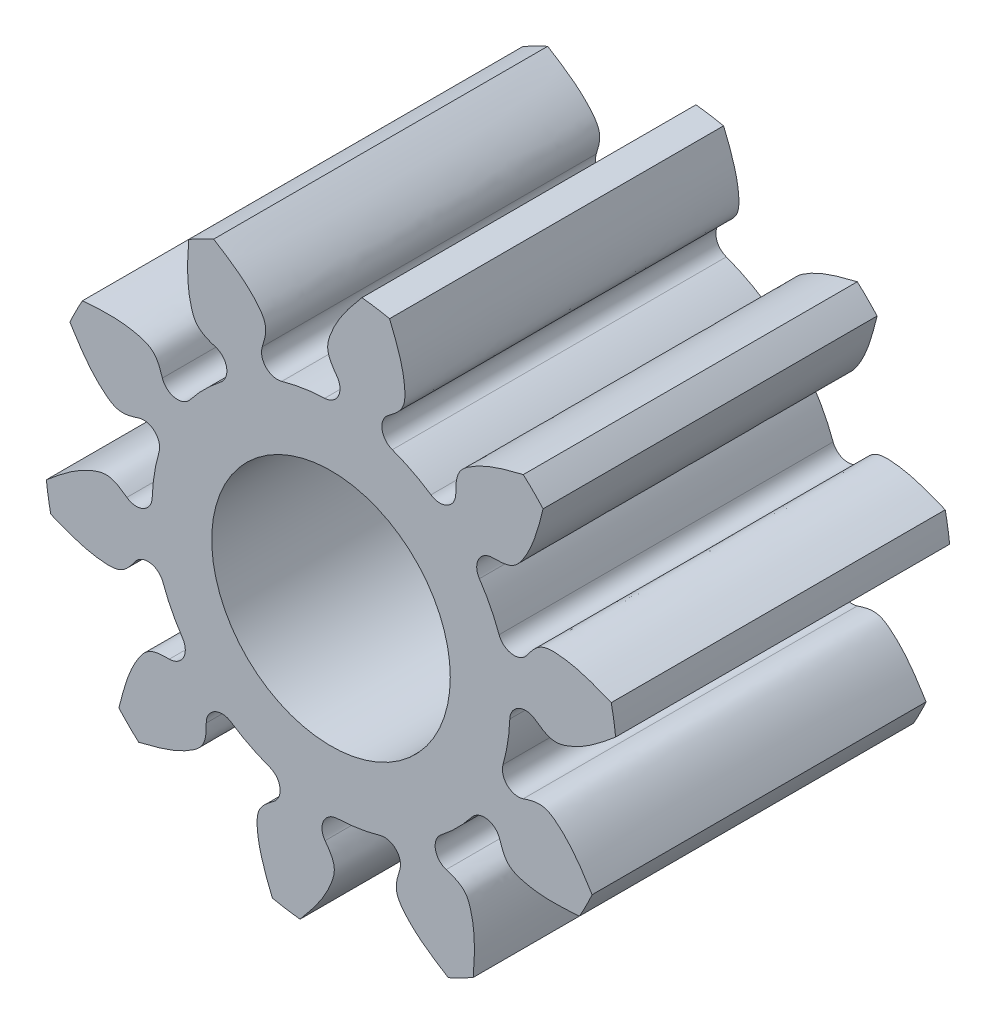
ISO-10303-21;
HEADER;
FILE_DESCRIPTION(('STEP AP214'),'2;1');
FILE_NAME('part.step','',(''),(''),'','','');
FILE_SCHEMA(('AUTOMOTIVE_DESIGN { 1 0 10303 214 1 1 1 1 }'));
ENDSEC;
DATA;
#1=APPLICATION_CONTEXT('core data for automotive mechanical design processes');
#2=APPLICATION_PROTOCOL_DEFINITION('international standard','automotive_design',2000,#1);
#3=PRODUCT_CONTEXT('',#1,'mechanical');
#4=PRODUCT('Part','Part','',(#3));
#5=PRODUCT_RELATED_PRODUCT_CATEGORY('part','',(#4));
#6=PRODUCT_DEFINITION_FORMATION('','',#4);
#7=PRODUCT_DEFINITION_CONTEXT('part definition',#1,'design');
#8=PRODUCT_DEFINITION('design','',#6,#7);
#9=PRODUCT_DEFINITION_SHAPE('','',#8);
#10=(LENGTH_UNIT() NAMED_UNIT(*) SI_UNIT(.MILLI.,.METRE.));
#11=(NAMED_UNIT(*) PLANE_ANGLE_UNIT() SI_UNIT($,.RADIAN.));
#12=(NAMED_UNIT(*) SI_UNIT($,.STERADIAN.) SOLID_ANGLE_UNIT());
#13=UNCERTAINTY_MEASURE_WITH_UNIT(LENGTH_MEASURE(1.E-05),#10,'distance_accuracy_value','');
#14=(GEOMETRIC_REPRESENTATION_CONTEXT(3) GLOBAL_UNCERTAINTY_ASSIGNED_CONTEXT((#13)) GLOBAL_UNIT_ASSIGNED_CONTEXT((#10,
#11,#12)) REPRESENTATION_CONTEXT('',''));
#15=CARTESIAN_POINT('',(0.,0.,0.));
#16=DIRECTION('',(0.,0.,1.));
#17=DIRECTION('',(1.,0.,0.));
#18=AXIS2_PLACEMENT_3D('',#15,#16,#17);
#19=CARTESIAN_POINT('',(0.,0.,3.5));
#20=DIRECTION('',(0.,0.,1.));
#21=DIRECTION('',(1.,0.,0.));
#22=AXIS2_PLACEMENT_3D('',#19,#20,#21);
#23=PLANE('',#22);
#24=CARTESIAN_POINT('',(1.49079470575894,-2.6033691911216,3.5));
#25=CARTESIAN_POINT('',(1.5043356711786,-2.41042655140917,3.5));
#26=CARTESIAN_POINT('',(1.52149060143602,-2.16598921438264,3.5));
#27=CARTESIAN_POINT('',(1.38931667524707,-1.77127088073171,3.5));
#28=CARTESIAN_POINT('',(1.09479493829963,-1.76706724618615,3.5));
#29=CARTESIAN_POINT('',(0.957744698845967,-1.64942257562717,3.5));
#30=CARTESIAN_POINT('',(0.931746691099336,-1.627105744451,3.5));
#31=B_SPLINE_CURVE_WITH_KNOTS('',3,(#24,#25,#26,#27,#28,#29,#30),.UNSPECIFIED.,.F.,.F.,(4,1,1,1,
4),(0.,0.454710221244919,0.576068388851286,0.919581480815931,1.),.UNSPECIFIED.);
#32=CARTESIAN_POINT('',(1.49079470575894,-2.6033691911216,3.5));
#33=VERTEX_POINT('',#32);
#34=CARTESIAN_POINT('',(1.20683568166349,-1.76676559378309,3.5));
#35=VERTEX_POINT('',#34);
#36=EDGE_CURVE('E1040',#33,#35,#31,.T.);
#37=ORIENTED_EDGE('',*,*,#36,.T.);
#38=CARTESIAN_POINT('',(1.25777636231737,-1.60814463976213,3.5));
#39=DIRECTION('',(0.,0.,1.));
#40=DIRECTION('',(1.,0.,0.));
#41=AXIS2_PLACEMENT_3D('',#38,#39,#40);
#42=CIRCLE('',#41,0.1666);
#43=CARTESIAN_POINT('',(1.15513845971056,-1.47691575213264,3.5));
#44=VERTEX_POINT('',#43);
#45=EDGE_CURVE('E1441',#35,#44,#42,.F.);
#46=ORIENTED_EDGE('',*,*,#45,.T.);
#47=CARTESIAN_POINT('',(0.,0.,3.5));
#48=DIRECTION('',(0.,0.,1.));
#49=DIRECTION('',(1.,0.,0.));
#50=AXIS2_PLACEMENT_3D('',#47,#48,#49);
#51=CIRCLE('',#50,1.875);
#52=CARTESIAN_POINT('',(1.47673175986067,-1.15537366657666,3.5));
#53=VERTEX_POINT('',#52);
#54=EDGE_CURVE('E1468',#44,#53,#51,.T.);
#55=ORIENTED_EDGE('',*,*,#54,.T.);
#56=CARTESIAN_POINT('',(1.60794429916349,-1.25803246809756,3.5));
#57=DIRECTION('',(0.,0.,1.));
#58=DIRECTION('',(1.,0.,0.));
#59=AXIS2_PLACEMENT_3D('',#56,#57,#58);
#60=CIRCLE('',#59,0.1666);
#61=CARTESIAN_POINT('',(1.76657336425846,-1.20711705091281,3.5));
#62=VERTEX_POINT('',#61);
#63=EDGE_CURVE('E11',#53,#62,#60,.F.);
#64=ORIENTED_EDGE('',*,*,#63,.T.);
#65=CARTESIAN_POINT('',(1.62695732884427,-0.932005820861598,3.5));
#66=CARTESIAN_POINT('',(1.64927001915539,-0.958007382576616,3.5));
#67=CARTESIAN_POINT('',(1.76689286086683,-1.09507635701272,3.5));
#68=CARTESIAN_POINT('',(1.77104958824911,-1.38959875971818,3.5));
#69=CARTESIAN_POINT('',(2.16574686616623,-1.52183554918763,3.5));
#70=CARTESIAN_POINT('',(2.41018693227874,-1.50471954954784,3.5));
#71=CARTESIAN_POINT('',(2.60313172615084,-1.49120931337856,3.5));
#72=B_SPLINE_CURVE_WITH_KNOTS('',3,(#65,#66,#67,#68,#69,#70,#71),.UNSPECIFIED.,.F.,.F.,(4,1,1,1,
4),(0.,0.0804185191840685,0.423931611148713,0.54528977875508,1.),.UNSPECIFIED.);
#73=CARTESIAN_POINT('',(2.60313172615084,-1.49120931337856,3.5));
#74=VERTEX_POINT('',#73);
#75=EDGE_CURVE('E1058',#62,#74,#72,.T.);
#76=ORIENTED_EDGE('',*,*,#75,.T.);
#77=CARTESIAN_POINT('',(0.,0.,3.5));
#78=DIRECTION('',(0.,0.,1.));
#79=DIRECTION('',(0.809016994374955,-0.587785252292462,0.));
#80=AXIS2_PLACEMENT_3D('',#77,#78,#79);
#81=CIRCLE('',#80,3.);
#82=CARTESIAN_POINT('',(2.73630026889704,-1.22990277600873,3.5));
#83=VERTEX_POINT('',#82);
#84=EDGE_CURVE('E748',#74,#83,#81,.T.);
#85=ORIENTED_EDGE('',*,*,#84,.T.);
#86=CARTESIAN_POINT('',(2.73630026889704,-1.22990277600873,3.5));
#87=CARTESIAN_POINT('',(2.63384630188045,-1.06584972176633,3.5));
#88=CARTESIAN_POINT('',(2.50404827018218,-0.858012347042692,3.5));
#89=CARTESIAN_POINT('',(2.16510770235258,-0.616368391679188,3.5));
#90=CARTESIAN_POINT('',(1.92436377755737,-0.786083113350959,3.5));
#91=CARTESIAN_POINT('',(1.74433800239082,-0.771462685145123,3.5));
#92=CARTESIAN_POINT('',(1.71018766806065,-0.768689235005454,3.5));
#93=B_SPLINE_CURVE_WITH_KNOTS('',3,(#86,#87,#88,#89,#90,#91,#92),.UNSPECIFIED.,.F.,.F.,(4,1,1,1,
4),(0.,0.454710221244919,0.576068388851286,0.919581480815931,1.),.UNSPECIFIED.);
#94=CARTESIAN_POINT('',(2.01482933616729,-0.719983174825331,3.5));
#95=VERTEX_POINT('',#94);
#96=EDGE_CURVE('E754',#83,#95,#93,.T.);
#97=ORIENTED_EDGE('',*,*,#96,.T.);
#98=CARTESIAN_POINT('',(1.96280615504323,-0.561713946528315,3.5));
#99=DIRECTION('',(0.,0.,1.));
#100=DIRECTION('',(1.,0.,0.));
#101=AXIS2_PLACEMENT_3D('',#98,#99,#100);
#102=CIRCLE('',#101,0.1666);
#103=CARTESIAN_POINT('',(1.80263594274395,-0.515876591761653,3.5));
#104=VERTEX_POINT('',#103);
#105=EDGE_CURVE('E1456',#95,#104,#102,.F.);
#106=ORIENTED_EDGE('',*,*,#105,.T.);
#107=CARTESIAN_POINT('',(1.87381269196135,-0.0667157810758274,3.5));
#108=VERTEX_POINT('',#107);
#109=EDGE_CURVE('E1277',#104,#108,#51,.T.);
#110=ORIENTED_EDGE('',*,*,#109,.T.);
#111=CARTESIAN_POINT('',(2.04030719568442,-0.0726437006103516,3.5));
#112=DIRECTION('',(0.,0.,1.));
#113=DIRECTION('',(1.,0.,0.));
#114=AXIS2_PLACEMENT_3D('',#111,#112,#113);
#115=CIRCLE('',#114,0.1666);
#116=CARTESIAN_POINT('',(2.13871347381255,0.0617875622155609,3.5));
#117=VERTEX_POINT('',#116);
#118=EDGE_CURVE('E1301',#108,#117,#115,.F.);
#119=ORIENTED_EDGE('',*,*,#118,.T.);
#120=CARTESIAN_POINT('',(1.86405540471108,0.20229297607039,3.5));
#121=CARTESIAN_POINT('',(1.89739008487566,0.194372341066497,3.5));
#122=CARTESIAN_POINT('',(2.07311608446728,0.152618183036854,3.5));
#123=CARTESIAN_POINT('',(2.24959487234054,-0.0832121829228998,3.5));
#124=CARTESIAN_POINT('',(2.64663851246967,0.0418032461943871,3.5));
#125=CARTESIAN_POINT('',(2.83433414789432,0.199328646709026,3.5));
#126=CARTESIAN_POINT('',(2.98248864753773,0.323668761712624,3.5));
#127=B_SPLINE_CURVE_WITH_KNOTS('',3,(#120,#121,#122,#123,#124,#125,#126),.UNSPECIFIED.,.F.,.F.,
(4,1,1,1,4),(0.,0.0804185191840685,0.423931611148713,0.54528977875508,1.),.UNSPECIFIED.);
#128=CARTESIAN_POINT('',(2.98248864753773,0.323668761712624,3.5));
#129=VERTEX_POINT('',#128);
#130=EDGE_CURVE('E1009',#117,#129,#127,.T.);
#131=ORIENTED_EDGE('',*,*,#130,.T.);
#132=CARTESIAN_POINT('',(0.,0.,3.5));
#133=DIRECTION('',(0.,0.,1.));
#134=DIRECTION('',(1.,0.,0.));
#135=AXIS2_PLACEMENT_3D('',#132,#133,#134);
#136=CIRCLE('',#135,3.);
#137=CARTESIAN_POINT('',(2.93663213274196,0.613344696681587,3.5));
#138=VERTEX_POINT('',#137);
#139=EDGE_CURVE('E1017',#129,#138,#136,.T.);
#140=ORIENTED_EDGE('',*,*,#139,.T.);
#141=CARTESIAN_POINT('',(2.93663213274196,0.613344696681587,3.5));
#142=CARTESIAN_POINT('',(2.75731716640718,0.685845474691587,3.5));
#143=CARTESIAN_POINT('',(2.53014460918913,0.777696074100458,3.5));
#144=CARTESIAN_POINT('',(2.1139011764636,0.773965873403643,3.5));
#145=CARTESIAN_POINT('',(2.01889106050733,0.495158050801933,3.5));
#146=CARTESIAN_POINT('',(1.86465347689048,0.401169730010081,3.5));
#147=CARTESIAN_POINT('',(1.83539508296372,0.383340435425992,3.5));
#148=B_SPLINE_CURVE_WITH_KNOTS('',3,(#141,#142,#143,#144,#145,#146,#147),.UNSPECIFIED.,.F.,.F.,
(4,1,1,1,4),(0.,0.454710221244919,0.576068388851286,0.919581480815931,1.),.UNSPECIFIED.);
#149=CARTESIAN_POINT('',(2.05322666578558,0.601808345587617,3.5));
#150=VERTEX_POINT('',#149);
#151=EDGE_CURVE('E1258',#138,#150,#148,.T.);
#152=ORIENTED_EDGE('',*,*,#151,.T.);
#153=CARTESIAN_POINT('',(1.91811070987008,0.699272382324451,3.5));
#154=DIRECTION('',(0.,0.,1.));
#155=DIRECTION('',(1.,0.,0.));
#156=AXIS2_PLACEMENT_3D('',#153,#154,#155);
#157=CIRCLE('',#156,0.1666);
#158=CARTESIAN_POINT('',(1.76158776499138,0.642209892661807,3.5));
#159=VERTEX_POINT('',#158);
#160=EDGE_CURVE('E1296',#150,#159,#157,.F.);
#161=ORIENTED_EDGE('',*,*,#160,.T.);
#162=CARTESIAN_POINT('',(1.55516086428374,1.04742526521,3.5));
#163=VERTEX_POINT('',#162);
#164=EDGE_CURVE('E1279',#159,#163,#51,.T.);
#165=ORIENTED_EDGE('',*,*,#164,.T.);
#166=CARTESIAN_POINT('',(1.6933420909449,1.14049249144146,3.5));
#167=DIRECTION('',(0.,0.,1.));
#168=DIRECTION('',(1.,0.,0.));
#169=AXIS2_PLACEMENT_3D('',#166,#167,#168);
#170=CIRCLE('',#169,0.1666);
#171=CARTESIAN_POINT('',(1.69393772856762,1.30709142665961,3.5));
#172=VERTEX_POINT('',#171);
#173=EDGE_CURVE('E1319',#163,#172,#170,.F.);
#174=ORIENTED_EDGE('',*,*,#173,.T.);
#175=CARTESIAN_POINT('',(1.3891476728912,1.25932273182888,3.5));
#176=CARTESIAN_POINT('',(1.42077162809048,1.27250843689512,3.5));
#177=CARTESIAN_POINT('',(1.58747942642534,1.34201776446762,3.5));
#178=CARTESIAN_POINT('',(1.86887137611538,1.25495861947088,3.5));
#179=CARTESIAN_POINT('',(2.11660420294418,1.58947462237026,3.5));
#180=CARTESIAN_POINT('',(2.17586205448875,1.8272400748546,3.5));
#181=CARTESIAN_POINT('',(2.22263627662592,2.01491637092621,3.5));
#182=B_SPLINE_CURVE_WITH_KNOTS('',3,(#175,#176,#177,#178,#179,#180,#181),.UNSPECIFIED.,.F.,.F.,
(4,1,1,1,4),(0.,0.0804185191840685,0.423931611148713,0.54528977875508,1.),.UNSPECIFIED.);
#183=CARTESIAN_POINT('',(2.22263627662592,2.01491637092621,3.5));
#184=VERTEX_POINT('',#183);
#185=EDGE_CURVE('E1234',#172,#184,#182,.T.);
#186=ORIENTED_EDGE('',*,*,#185,.T.);
#187=CARTESIAN_POINT('',(0.,0.,3.5));
#188=DIRECTION('',(0.,0.,1.));
#189=DIRECTION('',(0.809016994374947,0.587785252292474,0.));
#190=AXIS2_PLACEMENT_3D('',#187,#188,#189);
#191=CIRCLE('',#190,3.);
#192=CARTESIAN_POINT('',(2.01527033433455,2.22231534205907,3.5));
#193=VERTEX_POINT('',#192);
#194=EDGE_CURVE('E985',#184,#193,#191,.T.);
#195=ORIENTED_EDGE('',*,*,#194,.T.);
#196=CARTESIAN_POINT('',(2.01527033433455,2.22231534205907,3.5));
#197=CARTESIAN_POINT('',(1.82758659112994,2.17557101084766,3.5));
#198=CARTESIAN_POINT('',(1.58981170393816,2.11635102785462,3.5));
#199=CARTESIAN_POINT('',(1.25525625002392,1.86867148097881,3.5));
#200=CARTESIAN_POINT('',(1.34227057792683,1.58726566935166,3.5));
#201=CARTESIAN_POINT('',(1.27273470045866,1.42056894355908,3.5));
#202=CARTESIAN_POINT('',(1.25954395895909,1.38894708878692,3.5));
#203=B_SPLINE_CURVE_WITH_KNOTS('',3,(#196,#197,#198,#199,#200,#201,#202),.UNSPECIFIED.,.F.,.F.,
(4,1,1,1,4),(0.,0.454710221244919,0.576068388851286,0.919581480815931,1.),.UNSPECIFIED.);
#204=CARTESIAN_POINT('',(1.30736119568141,1.69372953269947,3.5));
#205=VERTEX_POINT('',#204);
#206=EDGE_CURVE('E977',#193,#205,#203,.T.);
#207=ORIENTED_EDGE('',*,*,#206,.T.);
#208=CARTESIAN_POINT('',(1.14076216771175,1.69316042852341,3.5));
#209=DIRECTION('',(0.,0.,1.));
#210=DIRECTION('',(1.,0.,0.));
#211=AXIS2_PLACEMENT_3D('',#208,#209,#210);
#212=CIRCLE('',#211,0.1666);
#213=CARTESIAN_POINT('',(1.04767293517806,1.5549940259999,3.5));
#214=VERTEX_POINT('',#213);
#215=EDGE_CURVE('E1315',#205,#214,#212,.F.);
#216=ORIENTED_EDGE('',*,*,#215,.T.);
#217=CARTESIAN_POINT('',(0.642490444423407,1.76148546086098,3.5));
#218=VERTEX_POINT('',#217);
#219=EDGE_CURVE('E1283',#214,#218,#51,.T.);
#220=ORIENTED_EDGE('',*,*,#219,.T.);
#221=CARTESIAN_POINT('',(0.699577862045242,1.91799931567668,3.5));
#222=DIRECTION('',(0.,0.,1.));
#223=DIRECTION('',(1.,0.,0.));
#224=AXIS2_PLACEMENT_3D('',#221,#222,#223);
#225=CIRCLE('',#224,0.1666);
#226=CARTESIAN_POINT('',(0.60213534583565,2.05313079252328,3.5));
#227=VERTEX_POINT('',#226);
#228=EDGE_CURVE('E1337',#218,#227,#225,.F.);
#229=ORIENTED_EDGE('',*,*,#228,.T.);
#230=CARTESIAN_POINT('',(0.383632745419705,1.83533400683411,3.5));
#231=CARTESIAN_POINT('',(0.401466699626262,1.8645895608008,3.5));
#232=CARTESIAN_POINT('',(0.495479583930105,2.01881217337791,3.5));
#233=CARTESIAN_POINT('',(0.77430253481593,2.11377788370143,3.5));
#234=CARTESIAN_POINT('',(0.77809902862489,2.5300207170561,3.5));
#235=CARTESIAN_POINT('',(0.686284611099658,2.75720790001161,3.5));
#236=CARTESIAN_POINT('',(0.613812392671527,2.93653441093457,3.5));
#237=B_SPLINE_CURVE_WITH_KNOTS('',3,(#230,#231,#232,#233,#234,#235,#236),.UNSPECIFIED.,.F.,.F.,
(4,1,1,1,4),(0.,0.0804185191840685,0.423931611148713,0.54528977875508,1.),.UNSPECIFIED.);
#238=CARTESIAN_POINT('',(0.613812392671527,2.93653441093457,3.5));
#239=VERTEX_POINT('',#238);
#240=EDGE_CURVE('E949',#227,#239,#237,.T.);
#241=ORIENTED_EDGE('',*,*,#240,.T.);
#242=CARTESIAN_POINT('',(0.,0.,3.5));
#243=DIRECTION('',(0.,0.,1.));
#244=DIRECTION('',(0.309016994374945,0.951056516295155,0.));
#245=AXIS2_PLACEMENT_3D('',#242,#243,#244);
#246=CIRCLE('',#245,3.);
#247=CARTESIAN_POINT('',(0.324143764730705,2.98243706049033,3.5));
#248=VERTEX_POINT('',#247);
#249=EDGE_CURVE('E957',#239,#248,#246,.T.);
#250=ORIENTED_EDGE('',*,*,#249,.T.);
#251=CARTESIAN_POINT('',(0.324143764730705,2.98243706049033,3.5));
#252=CARTESIAN_POINT('',(0.19978005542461,2.83430236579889,3.5));
#253=CARTESIAN_POINT('',(0.0422247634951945,2.6466318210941,3.5));
#254=CARTESIAN_POINT('',(-0.0828538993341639,2.24960809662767,3.5));
#255=CARTESIAN_POINT('',(0.152948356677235,2.0730917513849,3.5));
#256=CARTESIAN_POINT('',(0.194674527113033,1.89735910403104,3.5));
#257=CARTESIAN_POINT('',(0.202589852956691,1.86402316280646,3.5));
#258=B_SPLINE_CURVE_WITH_KNOTS('',3,(#251,#252,#253,#254,#255,#256,#257),.UNSPECIFIED.,.F.,.F.,
(4,1,1,1,4),(0.,0.454710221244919,0.576068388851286,0.919581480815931,1.),.UNSPECIFIED.);
#259=CARTESIAN_POINT('',(0.0621281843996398,2.13870360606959,3.5));
#260=VERTEX_POINT('',#259);
#261=EDGE_CURVE('E1206',#248,#260,#258,.T.);
#262=ORIENTED_EDGE('',*,*,#261,.T.);
#263=CARTESIAN_POINT('',(-0.0723187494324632,2.04031873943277,3.5));
#264=DIRECTION('',(0.,0.,1.));
#265=DIRECTION('',(1.,0.,0.));
#266=AXIS2_PLACEMENT_3D('',#263,#264,#265);
#267=CIRCLE('',#266,0.1666);
#268=CARTESIAN_POINT('',(-0.0664173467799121,1.87382329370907,3.5));
#269=VERTEX_POINT('',#268);
#270=EDGE_CURVE('E1333',#260,#269,#267,.F.);
#271=ORIENTED_EDGE('',*,*,#270,.T.);
#272=CARTESIAN_POINT('',(-0.515589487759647,1.80271808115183,3.5));
#273=VERTEX_POINT('',#272);
#274=EDGE_CURVE('E1986',#269,#273,#51,.T.);
#275=ORIENTED_EDGE('',*,*,#274,.T.);
#276=CARTESIAN_POINT('',(-0.561401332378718,1.96289559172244,3.5));
#277=DIRECTION('',(0.,0.,1.));
#278=DIRECTION('',(1.,0.,0.));
#279=AXIS2_PLACEMENT_3D('',#276,#277,#278);
#280=CIRCLE('',#279,0.1666);
#281=CARTESIAN_POINT('',(-0.719662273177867,2.01494397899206,3.5));
#282=VERTEX_POINT('',#281);
#283=EDGE_CURVE('E1355',#273,#282,#280,.F.);
#284=ORIENTED_EDGE('',*,*,#283,.T.);
#285=CARTESIAN_POINT('',(-0.768416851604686,1.71031007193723,3.5));
#286=CARTESIAN_POINT('',(-0.771184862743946,1.74446084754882,3.5));
#287=CARTESIAN_POINT('',(-0.785776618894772,1.92448894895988,3.5));
#288=CARTESIAN_POINT('',(-0.616023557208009,2.16520584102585,3.5));
#289=CARTESIAN_POINT('',(-0.857613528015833,2.50418489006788,3.5));
#290=CARTESIAN_POINT('',(-1.06543022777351,2.63401602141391,3.5));
#291=CARTESIAN_POINT('',(-1.2294669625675,2.73649611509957,3.5));
#292=B_SPLINE_CURVE_WITH_KNOTS('',3,(#285,#286,#287,#288,#289,#290,#291),.UNSPECIFIED.,.F.,.F.,
(4,1,1,1,4),(0.,0.0804185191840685,0.423931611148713,0.54528977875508,1.),.UNSPECIFIED.);
#293=CARTESIAN_POINT('',(-1.2294669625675,2.73649611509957,3.5));
#294=VERTEX_POINT('',#293);
#295=EDGE_CURVE('E1190',#282,#294,#292,.T.);
#296=ORIENTED_EDGE('',*,*,#295,.T.);
#297=CARTESIAN_POINT('',(0.,0.,3.5));
#298=DIRECTION('',(0.,0.,1.));
#299=DIRECTION('',(-0.309016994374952,0.951056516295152,0.));
#300=AXIS2_PLACEMENT_3D('',#297,#298,#299);
#301=CIRCLE('',#300,3.);
#302=CARTESIAN_POINT('',(-1.49079470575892,2.60336919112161,3.5));
#303=VERTEX_POINT('',#302);
#304=EDGE_CURVE('E925',#294,#303,#301,.T.);
#305=ORIENTED_EDGE('',*,*,#304,.T.);
#306=CARTESIAN_POINT('',(-1.49079470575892,2.60336919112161,3.5));
#307=CARTESIAN_POINT('',(-1.50433567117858,2.41042655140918,3.5));
#308=CARTESIAN_POINT('',(-1.52149060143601,2.16598921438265,3.5));
#309=CARTESIAN_POINT('',(-1.38931667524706,1.77127088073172,3.5));
#310=CARTESIAN_POINT('',(-1.09479493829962,1.76706724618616,3.5));
#311=CARTESIAN_POINT('',(-0.957744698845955,1.64942257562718,3.5));
#312=CARTESIAN_POINT('',(-0.931746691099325,1.62710574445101,3.5));
#313=B_SPLINE_CURVE_WITH_KNOTS('',3,(#306,#307,#308,#309,#310,#311,#312),.UNSPECIFIED.,.F.,.F.,
(4,1,1,1,4),(0.,0.454710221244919,0.576068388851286,0.919581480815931,1.),.UNSPECIFIED.);
#314=CARTESIAN_POINT('',(-1.20683568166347,1.7667655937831,3.5));
#315=VERTEX_POINT('',#314);
#316=EDGE_CURVE('E917',#303,#315,#313,.T.);
#317=ORIENTED_EDGE('',*,*,#316,.T.);
#318=CARTESIAN_POINT('',(-1.25777636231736,1.60814463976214,3.5));
#319=DIRECTION('',(0.,0.,1.));
#320=DIRECTION('',(1.,0.,0.));
#321=AXIS2_PLACEMENT_3D('',#318,#319,#320);
#322=CIRCLE('',#321,0.1666);
#323=CARTESIAN_POINT('',(-1.15513845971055,1.47691575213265,3.5));
#324=VERTEX_POINT('',#323);
#325=EDGE_CURVE('E1351',#315,#324,#322,.F.);
#326=ORIENTED_EDGE('',*,*,#325,.T.);
#327=CARTESIAN_POINT('',(-1.47673175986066,1.15537366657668,3.5));
#328=VERTEX_POINT('',#327);
#329=EDGE_CURVE('E1982',#324,#328,#51,.T.);
#330=ORIENTED_EDGE('',*,*,#329,.T.);
#331=CARTESIAN_POINT('',(-1.60794429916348,1.25803246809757,3.5));
#332=DIRECTION('',(0.,0.,1.));
#333=DIRECTION('',(1.,0.,0.));
#334=AXIS2_PLACEMENT_3D('',#331,#332,#333);
#335=CIRCLE('',#334,0.1666);
#336=CARTESIAN_POINT('',(-1.76657336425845,1.20711705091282,3.5));
#337=VERTEX_POINT('',#336);
#338=EDGE_CURVE('E1373',#328,#337,#335,.F.);
#339=ORIENTED_EDGE('',*,*,#338,.T.);
#340=CARTESIAN_POINT('',(-1.62695732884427,0.93200582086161,3.5));
#341=CARTESIAN_POINT('',(-1.64927001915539,0.958007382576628,3.5));
#342=CARTESIAN_POINT('',(-1.76689286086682,1.09507635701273,3.5));
#343=CARTESIAN_POINT('',(-1.7710495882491,1.38959875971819,3.5));
#344=CARTESIAN_POINT('',(-2.16574686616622,1.52183554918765,3.5));
#345=CARTESIAN_POINT('',(-2.41018693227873,1.50471954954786,3.5));
#346=CARTESIAN_POINT('',(-2.60313172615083,1.49120931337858,3.5));
#347=B_SPLINE_CURVE_WITH_KNOTS('',3,(#340,#341,#342,#343,#344,#345,#346),.UNSPECIFIED.,.F.,.F.,
(4,1,1,1,4),(0.,0.0804185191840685,0.423931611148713,0.54528977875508,1.),.UNSPECIFIED.);
#348=CARTESIAN_POINT('',(-2.60313172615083,1.49120931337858,3.5));
#349=VERTEX_POINT('',#348);
#350=EDGE_CURVE('E889',#337,#349,#347,.T.);
#351=ORIENTED_EDGE('',*,*,#350,.T.);
#352=CARTESIAN_POINT('',(0.,0.,3.5));
#353=DIRECTION('',(0.,0.,1.));
#354=DIRECTION('',(-0.809016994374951,0.587785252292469,0.));
#355=AXIS2_PLACEMENT_3D('',#352,#353,#354);
#356=CIRCLE('',#355,3.);
#357=CARTESIAN_POINT('',(-2.73630026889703,1.22990277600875,3.5));
#358=VERTEX_POINT('',#357);
#359=EDGE_CURVE('E897',#349,#358,#356,.T.);
#360=ORIENTED_EDGE('',*,*,#359,.T.);
#361=CARTESIAN_POINT('',(-2.73630026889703,1.22990277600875,3.5));
#362=CARTESIAN_POINT('',(-2.63384630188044,1.06584972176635,3.5));
#363=CARTESIAN_POINT('',(-2.50404827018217,0.858012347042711,3.5));
#364=CARTESIAN_POINT('',(-2.16510770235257,0.616368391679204,3.5));
#365=CARTESIAN_POINT('',(-1.92436377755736,0.786083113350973,3.5));
#366=CARTESIAN_POINT('',(-1.74433800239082,0.771462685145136,3.5));
#367=CARTESIAN_POINT('',(-1.71018766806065,0.768689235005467,3.5));
#368=B_SPLINE_CURVE_WITH_KNOTS('',3,(#361,#362,#363,#364,#365,#366,#367),.UNSPECIFIED.,.F.,.F.,
(4,1,1,1,4),(0.,0.454710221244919,0.576068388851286,0.919581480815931,1.),.UNSPECIFIED.);
#369=CARTESIAN_POINT('',(-2.01482933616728,0.719983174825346,3.5));
#370=VERTEX_POINT('',#369);
#371=EDGE_CURVE('E1162',#358,#370,#368,.T.);
#372=ORIENTED_EDGE('',*,*,#371,.T.);
#373=CARTESIAN_POINT('',(-1.96280615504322,0.56171394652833,3.5));
#374=DIRECTION('',(0.,0.,1.));
#375=DIRECTION('',(1.,0.,0.));
#376=AXIS2_PLACEMENT_3D('',#373,#374,#375);
#377=CIRCLE('',#376,0.1666);
#378=CARTESIAN_POINT('',(-1.80263594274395,0.515876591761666,3.5));
#379=VERTEX_POINT('',#378);
#380=EDGE_CURVE('E1369',#370,#379,#377,.F.);
#381=ORIENTED_EDGE('',*,*,#380,.T.);
#382=CARTESIAN_POINT('',(-1.87381269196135,0.0667157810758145,3.5));
#383=VERTEX_POINT('',#382);
#384=EDGE_CURVE('E1978',#379,#383,#51,.T.);
#385=ORIENTED_EDGE('',*,*,#384,.T.);
#386=CARTESIAN_POINT('',(-2.04030719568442,0.0726437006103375,3.5));
#387=DIRECTION('',(0.,0.,1.));
#388=DIRECTION('',(1.,0.,0.));
#389=AXIS2_PLACEMENT_3D('',#386,#387,#388);
#390=CIRCLE('',#389,0.1666);
#391=CARTESIAN_POINT('',(-2.13871347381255,-0.0617875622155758,3.5));
#392=VERTEX_POINT('',#391);
#393=EDGE_CURVE('E1391',#383,#392,#390,.F.);
#394=ORIENTED_EDGE('',*,*,#393,.T.);
#395=CARTESIAN_POINT('',(-1.86405540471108,-0.202292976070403,3.5));
#396=CARTESIAN_POINT('',(-1.89739008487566,-0.19437234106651,3.5));
#397=CARTESIAN_POINT('',(-2.07311608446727,-0.152618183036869,3.5));
#398=CARTESIAN_POINT('',(-2.24959487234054,0.0832121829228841,3.5));
#399=CARTESIAN_POINT('',(-2.64663851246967,-0.0418032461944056,3.5));
#400=CARTESIAN_POINT('',(-2.83433414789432,-0.199328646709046,3.5));
#401=CARTESIAN_POINT('',(-2.98248864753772,-0.323668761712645,3.5));
#402=B_SPLINE_CURVE_WITH_KNOTS('',3,(#395,#396,#397,#398,#399,#400,#401),.UNSPECIFIED.,.F.,.F.,
(4,1,1,1,4),(0.,0.0804185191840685,0.423931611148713,0.54528977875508,1.),.UNSPECIFIED.);
#403=CARTESIAN_POINT('',(-2.98248864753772,-0.323668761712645,3.5));
#404=VERTEX_POINT('',#403);
#405=EDGE_CURVE('E1146',#392,#404,#402,.T.);
#406=ORIENTED_EDGE('',*,*,#405,.T.);
#407=CARTESIAN_POINT('',(0.,0.,3.5));
#408=DIRECTION('',(0.,0.,1.));
#409=DIRECTION('',(-1.,0.,0.));
#410=AXIS2_PLACEMENT_3D('',#407,#408,#409);
#411=CIRCLE('',#410,3.);
#412=CARTESIAN_POINT('',(-2.93663213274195,-0.613344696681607,3.5));
#413=VERTEX_POINT('',#412);
#414=EDGE_CURVE('E865',#404,#413,#411,.T.);
#415=ORIENTED_EDGE('',*,*,#414,.T.);
#416=CARTESIAN_POINT('',(-2.93663213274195,-0.613344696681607,3.5));
#417=CARTESIAN_POINT('',(-2.75731716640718,-0.685845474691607,3.5));
#418=CARTESIAN_POINT('',(-2.53014460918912,-0.777696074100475,3.5));
#419=CARTESIAN_POINT('',(-2.11390117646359,-0.773965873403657,3.5));
#420=CARTESIAN_POINT('',(-2.01889106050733,-0.495158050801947,3.5));
#421=CARTESIAN_POINT('',(-1.86465347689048,-0.401169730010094,3.5));
#422=CARTESIAN_POINT('',(-1.83539508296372,-0.383340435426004,3.5));
#423=B_SPLINE_CURVE_WITH_KNOTS('',3,(#416,#417,#418,#419,#420,#421,#422),.UNSPECIFIED.,.F.,.F.,
(4,1,1,1,4),(0.,0.454710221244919,0.576068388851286,0.919581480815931,1.),.UNSPECIFIED.);
#424=CARTESIAN_POINT('',(-2.05322666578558,-0.601808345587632,3.5));
#425=VERTEX_POINT('',#424);
#426=EDGE_CURVE('E857',#413,#425,#423,.T.);
#427=ORIENTED_EDGE('',*,*,#426,.T.);
#428=CARTESIAN_POINT('',(-1.91811070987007,-0.699272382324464,3.5));
#429=DIRECTION('',(0.,0.,1.));
#430=DIRECTION('',(1.,0.,0.));
#431=AXIS2_PLACEMENT_3D('',#428,#429,#430);
#432=CIRCLE('',#431,0.1666);
#433=CARTESIAN_POINT('',(-1.76158776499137,-0.642209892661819,3.5));
#434=VERTEX_POINT('',#433);
#435=EDGE_CURVE('E1387',#425,#434,#432,.F.);
#436=ORIENTED_EDGE('',*,*,#435,.T.);
#437=CARTESIAN_POINT('',(-1.55516086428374,-1.04742526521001,3.5));
#438=VERTEX_POINT('',#437);
#439=EDGE_CURVE('E1974',#434,#438,#51,.T.);
#440=ORIENTED_EDGE('',*,*,#439,.T.);
#441=CARTESIAN_POINT('',(-1.69334209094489,-1.14049249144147,3.5));
#442=DIRECTION('',(0.,0.,1.));
#443=DIRECTION('',(1.,0.,0.));
#444=AXIS2_PLACEMENT_3D('',#441,#442,#443);
#445=CIRCLE('',#444,0.1666);
#446=CARTESIAN_POINT('',(-1.69393772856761,-1.30709142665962,3.5));
#447=VERTEX_POINT('',#446);
#448=EDGE_CURVE('E1409',#438,#447,#445,.F.);
#449=ORIENTED_EDGE('',*,*,#448,.T.);
#450=CARTESIAN_POINT('',(-1.38914767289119,-1.25932273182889,3.5));
#451=CARTESIAN_POINT('',(-1.42077162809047,-1.27250843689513,3.5));
#452=CARTESIAN_POINT('',(-1.58747942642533,-1.34201776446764,3.5));
#453=CARTESIAN_POINT('',(-1.86887137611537,-1.25495861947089,3.5));
#454=CARTESIAN_POINT('',(-2.11660420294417,-1.58947462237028,3.5));
#455=CARTESIAN_POINT('',(-2.17586205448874,-1.82724007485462,3.5));
#456=CARTESIAN_POINT('',(-2.22263627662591,-2.01491637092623,3.5));
#457=B_SPLINE_CURVE_WITH_KNOTS('',3,(#450,#451,#452,#453,#454,#455,#456),.UNSPECIFIED.,.F.,.F.,
(4,1,1,1,4),(0.,0.0804185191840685,0.423931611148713,0.54528977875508,1.),.UNSPECIFIED.);
#458=CARTESIAN_POINT('',(-2.22263627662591,-2.01491637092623,3.5));
#459=VERTEX_POINT('',#458);
#460=EDGE_CURVE('E829',#447,#459,#457,.T.);
#461=ORIENTED_EDGE('',*,*,#460,.T.);
#462=CARTESIAN_POINT('',(0.,0.,3.5));
#463=DIRECTION('',(0.,0.,1.));
#464=DIRECTION('',(-0.809016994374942,-0.58778525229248,0.));
#465=AXIS2_PLACEMENT_3D('',#462,#463,#464);
#466=CIRCLE('',#465,3.);
#467=CARTESIAN_POINT('',(-2.01527033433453,-2.22231534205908,3.5));
#468=VERTEX_POINT('',#467);
#469=EDGE_CURVE('E837',#459,#468,#466,.T.);
#470=ORIENTED_EDGE('',*,*,#469,.T.);
#471=CARTESIAN_POINT('',(-2.01527033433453,-2.22231534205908,3.5));
#472=CARTESIAN_POINT('',(-1.82758659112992,-2.17557101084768,3.5));
#473=CARTESIAN_POINT('',(-1.58981170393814,-2.11635102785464,3.5));
#474=CARTESIAN_POINT('',(-1.25525625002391,-1.86867148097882,3.5));
#475=CARTESIAN_POINT('',(-1.34227057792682,-1.58726566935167,3.5));
#476=CARTESIAN_POINT('',(-1.27273470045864,-1.42056894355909,3.5));
#477=CARTESIAN_POINT('',(-1.25954395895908,-1.38894708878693,3.5));
#478=B_SPLINE_CURVE_WITH_KNOTS('',3,(#471,#472,#473,#474,#475,#476,#477),.UNSPECIFIED.,.F.,.F.,
(4,1,1,1,4),(0.,0.454710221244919,0.576068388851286,0.919581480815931,1.),.UNSPECIFIED.);
#479=CARTESIAN_POINT('',(-1.3073611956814,-1.69372953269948,3.5));
#480=VERTEX_POINT('',#479);
#481=EDGE_CURVE('E1118',#468,#480,#478,.T.);
#482=ORIENTED_EDGE('',*,*,#481,.T.);
#483=CARTESIAN_POINT('',(-1.14076216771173,-1.69316042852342,3.5));
#484=DIRECTION('',(0.,0.,1.));
#485=DIRECTION('',(1.,0.,0.));
#486=AXIS2_PLACEMENT_3D('',#483,#484,#485);
#487=CIRCLE('',#486,0.1666);
#488=CARTESIAN_POINT('',(-1.04767293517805,-1.55499402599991,3.5));
#489=VERTEX_POINT('',#488);
#490=EDGE_CURVE('E1405',#480,#489,#487,.F.);
#491=ORIENTED_EDGE('',*,*,#490,.T.);
#492=CARTESIAN_POINT('',(-0.642490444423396,-1.76148546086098,3.5));
#493=VERTEX_POINT('',#492);
#494=EDGE_CURVE('E1970',#489,#493,#51,.T.);
#495=ORIENTED_EDGE('',*,*,#494,.T.);
#496=CARTESIAN_POINT('',(-0.699577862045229,-1.91799931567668,3.5));
#497=DIRECTION('',(0.,0.,1.));
#498=DIRECTION('',(1.,0.,0.));
#499=AXIS2_PLACEMENT_3D('',#496,#497,#498);
#500=CIRCLE('',#499,0.1666);
#501=CARTESIAN_POINT('',(-0.602135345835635,-2.05313079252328,3.5));
#502=VERTEX_POINT('',#501);
#503=EDGE_CURVE('E1427',#493,#502,#500,.F.);
#504=ORIENTED_EDGE('',*,*,#503,.T.);
#505=CARTESIAN_POINT('',(-0.383632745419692,-1.83533400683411,3.5));
#506=CARTESIAN_POINT('',(-0.401466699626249,-1.86458956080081,3.5));
#507=CARTESIAN_POINT('',(-0.495479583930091,-2.01881217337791,3.5));
#508=CARTESIAN_POINT('',(-0.774302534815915,-2.11377788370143,3.5));
#509=CARTESIAN_POINT('',(-0.778099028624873,-2.53002071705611,3.5));
#510=CARTESIAN_POINT('',(-0.686284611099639,-2.75720790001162,3.5));
#511=CARTESIAN_POINT('',(-0.613812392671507,-2.93653441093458,3.5));
#512=B_SPLINE_CURVE_WITH_KNOTS('',3,(#505,#506,#507,#508,#509,#510,#511),.UNSPECIFIED.,.F.,.F.,
(4,1,1,1,4),(0.,0.0804185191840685,0.423931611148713,0.54528977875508,1.),.UNSPECIFIED.);
#513=CARTESIAN_POINT('',(-0.613812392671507,-2.93653441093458,3.5));
#514=VERTEX_POINT('',#513);
#515=EDGE_CURVE('E1102',#502,#514,#512,.T.);
#516=ORIENTED_EDGE('',*,*,#515,.T.);
#517=CARTESIAN_POINT('',(0.,0.,3.5));
#518=DIRECTION('',(0.,0.,1.));
#519=DIRECTION('',(-0.309016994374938,-0.951056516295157,0.));
#520=AXIS2_PLACEMENT_3D('',#517,#518,#519);
#521=CIRCLE('',#520,3.);
#522=CARTESIAN_POINT('',(-0.324143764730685,-2.98243706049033,3.5));
#523=VERTEX_POINT('',#522);
#524=EDGE_CURVE('E805',#514,#523,#521,.T.);
#525=ORIENTED_EDGE('',*,*,#524,.T.);
#526=CARTESIAN_POINT('',(-0.324143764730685,-2.98243706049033,3.5));
#527=CARTESIAN_POINT('',(-0.199780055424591,-2.8343023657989,3.5));
#528=CARTESIAN_POINT('',(-0.0422247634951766,-2.6466318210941,3.5));
#529=CARTESIAN_POINT('',(0.0828538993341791,-2.24960809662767,3.5));
#530=CARTESIAN_POINT('',(-0.152948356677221,-2.07309175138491,3.5));
#531=CARTESIAN_POINT('',(-0.19467452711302,-1.89735910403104,3.5));
#532=CARTESIAN_POINT('',(-0.202589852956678,-1.86402316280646,3.5));
#533=B_SPLINE_CURVE_WITH_KNOTS('',3,(#526,#527,#528,#529,#530,#531,#532),.UNSPECIFIED.,.F.,.F.,
(4,1,1,1,4),(0.,0.454710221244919,0.576068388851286,0.919581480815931,1.),.UNSPECIFIED.);
#534=CARTESIAN_POINT('',(-0.0621281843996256,-2.13870360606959,3.5));
#535=VERTEX_POINT('',#534);
#536=EDGE_CURVE('E797',#523,#535,#533,.T.);
#537=ORIENTED_EDGE('',*,*,#536,.T.);
#538=CARTESIAN_POINT('',(0.0723187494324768,-2.04031873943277,3.5));
#539=DIRECTION('',(0.,0.,1.));
#540=DIRECTION('',(1.,0.,0.));
#541=AXIS2_PLACEMENT_3D('',#538,#539,#540);
#542=CIRCLE('',#541,0.1666);
#543=CARTESIAN_POINT('',(0.0664173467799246,-1.87382329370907,3.5));
#544=VERTEX_POINT('',#543);
#545=EDGE_CURVE('E1423',#535,#544,#542,.F.);
#546=ORIENTED_EDGE('',*,*,#545,.T.);
#547=CARTESIAN_POINT('',(0.515589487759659,-1.80271808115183,3.5));
#548=VERTEX_POINT('',#547);
#549=EDGE_CURVE('E1968',#544,#548,#51,.T.);
#550=ORIENTED_EDGE('',*,*,#549,.T.);
#551=CARTESIAN_POINT('',(0.561401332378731,-1.96289559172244,3.5));
#552=DIRECTION('',(0.,0.,1.));
#553=DIRECTION('',(1.,0.,0.));
#554=AXIS2_PLACEMENT_3D('',#551,#552,#553);
#555=CIRCLE('',#554,0.1666);
#556=CARTESIAN_POINT('',(0.719662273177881,-2.01494397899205,3.5));
#557=VERTEX_POINT('',#556);
#558=EDGE_CURVE('E1445',#548,#557,#555,.F.);
#559=ORIENTED_EDGE('',*,*,#558,.T.);
#560=CARTESIAN_POINT('',(0.768416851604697,-1.71031007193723,3.5));
#561=CARTESIAN_POINT('',(0.771184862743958,-1.74446084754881,3.5));
#562=CARTESIAN_POINT('',(0.785776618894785,-1.92448894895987,3.5));
#563=CARTESIAN_POINT('',(0.616023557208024,-2.16520584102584,3.5));
#564=CARTESIAN_POINT('',(0.857613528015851,-2.50418489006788,3.5));
#565=CARTESIAN_POINT('',(1.06543022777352,-2.6340160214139,3.5));
#566=CARTESIAN_POINT('',(1.22946696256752,-2.73649611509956,3.5));
#567=B_SPLINE_CURVE_WITH_KNOTS('',3,(#560,#561,#562,#563,#564,#565,#566),.UNSPECIFIED.,.F.,.F.,
(4,1,1,1,4),(0.,0.0804185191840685,0.423931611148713,0.54528977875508,1.),.UNSPECIFIED.);
#568=CARTESIAN_POINT('',(1.22946696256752,-2.73649611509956,3.5));
#569=VERTEX_POINT('',#568);
#570=EDGE_CURVE('E769',#557,#569,#567,.T.);
#571=ORIENTED_EDGE('',*,*,#570,.T.);
#572=CARTESIAN_POINT('',(0.,0.,3.5));
#573=DIRECTION('',(0.,0.,1.));
#574=DIRECTION('',(0.309016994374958,-0.95105651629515,0.));
#575=AXIS2_PLACEMENT_3D('',#572,#573,#574);
#576=CIRCLE('',#575,3.);
#577=EDGE_CURVE('E777',#569,#33,#576,.T.);
#578=ORIENTED_EDGE('',*,*,#577,.T.);
#579=EDGE_LOOP('',(#37,#46,#55,#64,#76,#85,#97,#106,#110,#119,#131,#140,#152,#161,#165,#174,
#186,#195,#207,#216,#220,#229,#241,#250,#262,#271,#275,#284,#296,#305,#317,#326,#330,#339,#351,
#360,#372,#381,#385,#394,#406,#415,#427,#436,#440,#449,#461,#470,#482,#491,#495,#504,#516,#525,
#537,#546,#550,#559,#571,#578));
#580=FACE_BOUND('',#579,.T.);
#581=CARTESIAN_POINT('',(0.,0.,3.5));
#582=DIRECTION('',(0.,0.,1.));
#583=DIRECTION('',(1.,0.,0.));
#584=AXIS2_PLACEMENT_3D('',#581,#582,#583);
#585=CIRCLE('',#584,1.25);
#586=CARTESIAN_POINT('',(1.25,0.,3.5));
#587=VERTEX_POINT('',#586);
#588=EDGE_CURVE('E734',#587,#587,#585,.T.);
#589=ORIENTED_EDGE('',*,*,#588,.F.);
#590=EDGE_LOOP('',(#589));
#591=FACE_BOUND('',#590,.T.);
#592=ADVANCED_FACE('F348',(#580,#591),#23,.T.);
#593=CARTESIAN_POINT('',(0.,0.,0.));
#594=DIRECTION('',(0.,0.,1.));
#595=DIRECTION('',(1.,0.,0.));
#596=AXIS2_PLACEMENT_3D('',#593,#594,#595);
#597=PLANE('',#596);
#598=CARTESIAN_POINT('',(0.,0.,0.));
#599=DIRECTION('',(0.,0.,1.));
#600=DIRECTION('',(1.,0.,0.));
#601=AXIS2_PLACEMENT_3D('',#598,#599,#600);
#602=CIRCLE('',#601,1.875);
#603=CARTESIAN_POINT('',(1.80263594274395,-0.515876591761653,0.));
#604=VERTEX_POINT('',#603);
#605=CARTESIAN_POINT('',(1.87381269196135,-0.0667157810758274,0.));
#606=VERTEX_POINT('',#605);
#607=EDGE_CURVE('E1273',#604,#606,#602,.T.);
#608=ORIENTED_EDGE('',*,*,#607,.F.);
#609=CARTESIAN_POINT('',(1.96280615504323,-0.561713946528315,0.));
#610=DIRECTION('',(0.,0.,1.));
#611=DIRECTION('',(1.,0.,0.));
#612=AXIS2_PLACEMENT_3D('',#609,#610,#611);
#613=CIRCLE('',#612,0.1666);
#614=CARTESIAN_POINT('',(2.01482933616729,-0.719983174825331,0.));
#615=VERTEX_POINT('',#614);
#616=EDGE_CURVE('E1454',#604,#615,#613,.T.);
#617=ORIENTED_EDGE('',*,*,#616,.T.);
#618=CARTESIAN_POINT('',(2.73630026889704,-1.22990277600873,0.));
#619=CARTESIAN_POINT('',(2.63384630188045,-1.06584972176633,0.));
#620=CARTESIAN_POINT('',(2.50404827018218,-0.858012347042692,0.));
#621=CARTESIAN_POINT('',(2.16510770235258,-0.616368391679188,0.));
#622=CARTESIAN_POINT('',(1.92436377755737,-0.786083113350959,0.));
#623=CARTESIAN_POINT('',(1.74433800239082,-0.771462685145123,0.));
#624=CARTESIAN_POINT('',(1.71018766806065,-0.768689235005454,0.));
#625=B_SPLINE_CURVE_WITH_KNOTS('',3,(#618,#619,#620,#621,#622,#623,#624),.UNSPECIFIED.,.F.,.F.,
(4,1,1,1,4),(0.,0.454710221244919,0.576068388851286,0.919581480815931,1.),.UNSPECIFIED.);
#626=CARTESIAN_POINT('',(2.73630026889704,-1.22990277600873,0.));
#627=VERTEX_POINT('',#626);
#628=EDGE_CURVE('E741',#627,#615,#625,.T.);
#629=ORIENTED_EDGE('',*,*,#628,.F.);
#630=CARTESIAN_POINT('',(0.,0.,0.));
#631=DIRECTION('',(0.,0.,1.));
#632=DIRECTION('',(0.809016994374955,-0.587785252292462,0.));
#633=AXIS2_PLACEMENT_3D('',#630,#631,#632);
#634=CIRCLE('',#633,3.);
#635=CARTESIAN_POINT('',(2.60313172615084,-1.49120931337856,0.));
#636=VERTEX_POINT('',#635);
#637=EDGE_CURVE('E733',#636,#627,#634,.T.);
#638=ORIENTED_EDGE('',*,*,#637,.F.);
#639=CARTESIAN_POINT('',(1.62695732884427,-0.932005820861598,0.));
#640=CARTESIAN_POINT('',(1.64927001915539,-0.958007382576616,0.));
#641=CARTESIAN_POINT('',(1.76689286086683,-1.09507635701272,0.));
#642=CARTESIAN_POINT('',(1.77104958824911,-1.38959875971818,0.));
#643=CARTESIAN_POINT('',(2.16574686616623,-1.52183554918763,0.));
#644=CARTESIAN_POINT('',(2.41018693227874,-1.50471954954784,0.));
#645=CARTESIAN_POINT('',(2.60313172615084,-1.49120931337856,0.));
#646=B_SPLINE_CURVE_WITH_KNOTS('',3,(#639,#640,#641,#642,#643,#644,#645),.UNSPECIFIED.,.F.,.F.,
(4,1,1,1,4),(0.,0.0804185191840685,0.423931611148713,0.54528977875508,1.),.UNSPECIFIED.);
#647=CARTESIAN_POINT('',(1.76657336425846,-1.20711705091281,0.));
#648=VERTEX_POINT('',#647);
#649=EDGE_CURVE('E725',#648,#636,#646,.T.);
#650=ORIENTED_EDGE('',*,*,#649,.F.);
#651=CARTESIAN_POINT('',(1.60794429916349,-1.25803246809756,0.));
#652=DIRECTION('',(0.,0.,1.));
#653=DIRECTION('',(1.,0.,0.));
#654=AXIS2_PLACEMENT_3D('',#651,#652,#653);
#655=CIRCLE('',#654,0.1666);
#656=CARTESIAN_POINT('',(1.47673175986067,-1.15537366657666,0.));
#657=VERTEX_POINT('',#656);
#658=EDGE_CURVE('E356',#648,#657,#655,.T.);
#659=ORIENTED_EDGE('',*,*,#658,.T.);
#660=CARTESIAN_POINT('',(1.15513845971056,-1.47691575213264,0.));
#661=VERTEX_POINT('',#660);
#662=EDGE_CURVE('E1961',#661,#657,#602,.T.);
#663=ORIENTED_EDGE('',*,*,#662,.F.);
#664=CARTESIAN_POINT('',(1.25777636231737,-1.60814463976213,0.));
#665=DIRECTION('',(0.,0.,1.));
#666=DIRECTION('',(1.,0.,0.));
#667=AXIS2_PLACEMENT_3D('',#664,#665,#666);
#668=CIRCLE('',#667,0.1666);
#669=CARTESIAN_POINT('',(1.20683568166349,-1.76676559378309,0.));
#670=VERTEX_POINT('',#669);
#671=EDGE_CURVE('E1439',#661,#670,#668,.T.);
#672=ORIENTED_EDGE('',*,*,#671,.T.);
#673=CARTESIAN_POINT('',(1.49079470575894,-2.6033691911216,0.));
#674=CARTESIAN_POINT('',(1.5043356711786,-2.41042655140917,0.));
#675=CARTESIAN_POINT('',(1.52149060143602,-2.16598921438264,0.));
#676=CARTESIAN_POINT('',(1.38931667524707,-1.77127088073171,0.));
#677=CARTESIAN_POINT('',(1.09479493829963,-1.76706724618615,0.));
#678=CARTESIAN_POINT('',(0.957744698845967,-1.64942257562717,0.));
#679=CARTESIAN_POINT('',(0.931746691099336,-1.627105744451,0.));
#680=B_SPLINE_CURVE_WITH_KNOTS('',3,(#673,#674,#675,#676,#677,#678,#679),.UNSPECIFIED.,.F.,.F.,
(4,1,1,1,4),(0.,0.454710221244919,0.576068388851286,0.919581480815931,1.),.UNSPECIFIED.);
#681=CARTESIAN_POINT('',(1.49079470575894,-2.6033691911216,0.));
#682=VERTEX_POINT('',#681);
#683=EDGE_CURVE('E764',#682,#670,#680,.T.);
#684=ORIENTED_EDGE('',*,*,#683,.F.);
#685=CARTESIAN_POINT('',(0.,0.,0.));
#686=DIRECTION('',(0.,0.,1.));
#687=DIRECTION('',(0.309016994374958,-0.95105651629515,0.));
#688=AXIS2_PLACEMENT_3D('',#685,#686,#687);
#689=CIRCLE('',#688,3.);
#690=CARTESIAN_POINT('',(1.22946696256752,-2.73649611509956,0.));
#691=VERTEX_POINT('',#690);
#692=EDGE_CURVE('E752',#691,#682,#689,.T.);
#693=ORIENTED_EDGE('',*,*,#692,.F.);
#694=CARTESIAN_POINT('',(0.768416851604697,-1.71031007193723,0.));
#695=CARTESIAN_POINT('',(0.771184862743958,-1.74446084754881,0.));
#696=CARTESIAN_POINT('',(0.785776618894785,-1.92448894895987,0.));
#697=CARTESIAN_POINT('',(0.616023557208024,-2.16520584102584,0.));
#698=CARTESIAN_POINT('',(0.857613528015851,-2.50418489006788,0.));
#699=CARTESIAN_POINT('',(1.06543022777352,-2.6340160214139,0.));
#700=CARTESIAN_POINT('',(1.22946696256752,-2.73649611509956,0.));
#701=B_SPLINE_CURVE_WITH_KNOTS('',3,(#694,#695,#696,#697,#698,#699,#700),.UNSPECIFIED.,.F.,.F.,
(4,1,1,1,4),(0.,0.0804185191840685,0.423931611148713,0.54528977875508,1.),.UNSPECIFIED.);
#702=CARTESIAN_POINT('',(0.719662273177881,-2.01494397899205,0.));
#703=VERTEX_POINT('',#702);
#704=EDGE_CURVE('E749',#703,#691,#701,.T.);
#705=ORIENTED_EDGE('',*,*,#704,.F.);
#706=CARTESIAN_POINT('',(0.561401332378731,-1.96289559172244,0.));
#707=DIRECTION('',(0.,0.,1.));
#708=DIRECTION('',(1.,0.,0.));
#709=AXIS2_PLACEMENT_3D('',#706,#707,#708);
#710=CIRCLE('',#709,0.1666);
#711=CARTESIAN_POINT('',(0.515589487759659,-1.80271808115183,0.));
#712=VERTEX_POINT('',#711);
#713=EDGE_CURVE('E1443',#703,#712,#710,.T.);
#714=ORIENTED_EDGE('',*,*,#713,.T.);
#715=CARTESIAN_POINT('',(0.0664173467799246,-1.87382329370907,0.));
#716=VERTEX_POINT('',#715);
#717=EDGE_CURVE('E1957',#716,#712,#602,.T.);
#718=ORIENTED_EDGE('',*,*,#717,.F.);
#719=CARTESIAN_POINT('',(0.0723187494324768,-2.04031873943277,0.));
#720=DIRECTION('',(0.,0.,1.));
#721=DIRECTION('',(1.,0.,0.));
#722=AXIS2_PLACEMENT_3D('',#719,#720,#721);
#723=CIRCLE('',#722,0.1666);
#724=CARTESIAN_POINT('',(-0.0621281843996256,-2.13870360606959,0.));
#725=VERTEX_POINT('',#724);
#726=EDGE_CURVE('E1421',#716,#725,#723,.T.);
#727=ORIENTED_EDGE('',*,*,#726,.T.);
#728=CARTESIAN_POINT('',(-0.324143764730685,-2.98243706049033,0.));
#729=CARTESIAN_POINT('',(-0.199780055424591,-2.8343023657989,0.));
#730=CARTESIAN_POINT('',(-0.0422247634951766,-2.6466318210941,0.));
#731=CARTESIAN_POINT('',(0.0828538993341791,-2.24960809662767,0.));
#732=CARTESIAN_POINT('',(-0.152948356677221,-2.07309175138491,0.));
#733=CARTESIAN_POINT('',(-0.19467452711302,-1.89735910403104,0.));
#734=CARTESIAN_POINT('',(-0.202589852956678,-1.86402316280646,0.));
#735=B_SPLINE_CURVE_WITH_KNOTS('',3,(#728,#729,#730,#731,#732,#733,#734),.UNSPECIFIED.,.F.,.F.,
(4,1,1,1,4),(0.,0.454710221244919,0.576068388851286,0.919581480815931,1.),.UNSPECIFIED.);
#736=CARTESIAN_POINT('',(-0.324143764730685,-2.98243706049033,0.));
#737=VERTEX_POINT('',#736);
#738=EDGE_CURVE('E1098',#737,#725,#735,.T.);
#739=ORIENTED_EDGE('',*,*,#738,.F.);
#740=CARTESIAN_POINT('',(0.,0.,0.));
#741=DIRECTION('',(0.,0.,1.));
#742=DIRECTION('',(-0.309016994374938,-0.951056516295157,0.));
#743=AXIS2_PLACEMENT_3D('',#740,#741,#742);
#744=CIRCLE('',#743,3.);
#745=CARTESIAN_POINT('',(-0.613812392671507,-2.93653441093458,0.));
#746=VERTEX_POINT('',#745);
#747=EDGE_CURVE('E1093',#746,#737,#744,.T.);
#748=ORIENTED_EDGE('',*,*,#747,.F.);
#749=CARTESIAN_POINT('',(-0.383632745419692,-1.83533400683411,0.));
#750=CARTESIAN_POINT('',(-0.401466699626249,-1.86458956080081,0.));
#751=CARTESIAN_POINT('',(-0.495479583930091,-2.01881217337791,0.));
#752=CARTESIAN_POINT('',(-0.774302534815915,-2.11377788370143,0.));
#753=CARTESIAN_POINT('',(-0.778099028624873,-2.53002071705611,0.));
#754=CARTESIAN_POINT('',(-0.686284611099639,-2.75720790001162,0.));
#755=CARTESIAN_POINT('',(-0.613812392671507,-2.93653441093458,0.));
#756=B_SPLINE_CURVE_WITH_KNOTS('',3,(#749,#750,#751,#752,#753,#754,#755),.UNSPECIFIED.,.F.,.F.,
(4,1,1,1,4),(0.,0.0804185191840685,0.423931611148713,0.54528977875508,1.),.UNSPECIFIED.);
#757=CARTESIAN_POINT('',(-0.602135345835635,-2.05313079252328,0.));
#758=VERTEX_POINT('',#757);
#759=EDGE_CURVE('E1089',#758,#746,#756,.T.);
#760=ORIENTED_EDGE('',*,*,#759,.F.);
#761=CARTESIAN_POINT('',(-0.699577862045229,-1.91799931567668,0.));
#762=DIRECTION('',(0.,0.,1.));
#763=DIRECTION('',(1.,0.,0.));
#764=AXIS2_PLACEMENT_3D('',#761,#762,#763);
#765=CIRCLE('',#764,0.1666);
#766=CARTESIAN_POINT('',(-0.642490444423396,-1.76148546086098,0.));
#767=VERTEX_POINT('',#766);
#768=EDGE_CURVE('E1425',#758,#767,#765,.T.);
#769=ORIENTED_EDGE('',*,*,#768,.T.);
#770=CARTESIAN_POINT('',(-1.04767293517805,-1.55499402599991,0.));
#771=VERTEX_POINT('',#770);
#772=EDGE_CURVE('E1953',#771,#767,#602,.T.);
#773=ORIENTED_EDGE('',*,*,#772,.F.);
#774=CARTESIAN_POINT('',(-1.14076216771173,-1.69316042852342,0.));
#775=DIRECTION('',(0.,0.,1.));
#776=DIRECTION('',(1.,0.,0.));
#777=AXIS2_PLACEMENT_3D('',#774,#775,#776);
#778=CIRCLE('',#777,0.1666);
#779=CARTESIAN_POINT('',(-1.3073611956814,-1.69372953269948,0.));
#780=VERTEX_POINT('',#779);
#781=EDGE_CURVE('E1403',#771,#780,#778,.T.);
#782=ORIENTED_EDGE('',*,*,#781,.T.);
#783=CARTESIAN_POINT('',(-2.01527033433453,-2.22231534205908,0.));
#784=CARTESIAN_POINT('',(-1.82758659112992,-2.17557101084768,0.));
#785=CARTESIAN_POINT('',(-1.58981170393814,-2.11635102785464,0.));
#786=CARTESIAN_POINT('',(-1.25525625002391,-1.86867148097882,0.));
#787=CARTESIAN_POINT('',(-1.34227057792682,-1.58726566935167,0.));
#788=CARTESIAN_POINT('',(-1.27273470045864,-1.42056894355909,0.));
#789=CARTESIAN_POINT('',(-1.25954395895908,-1.38894708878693,0.));
#790=B_SPLINE_CURVE_WITH_KNOTS('',3,(#783,#784,#785,#786,#787,#788,#789),.UNSPECIFIED.,.F.,.F.,
(4,1,1,1,4),(0.,0.454710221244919,0.576068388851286,0.919581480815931,1.),.UNSPECIFIED.);
#791=CARTESIAN_POINT('',(-2.01527033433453,-2.22231534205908,0.));
#792=VERTEX_POINT('',#791);
#793=EDGE_CURVE('E824',#792,#780,#790,.T.);
#794=ORIENTED_EDGE('',*,*,#793,.F.);
#795=CARTESIAN_POINT('',(0.,0.,0.));
#796=DIRECTION('',(0.,0.,1.));
#797=DIRECTION('',(-0.809016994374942,-0.58778525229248,0.));
#798=AXIS2_PLACEMENT_3D('',#795,#796,#797);
#799=CIRCLE('',#798,3.);
#800=CARTESIAN_POINT('',(-2.22263627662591,-2.01491637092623,0.));
#801=VERTEX_POINT('',#800);
#802=EDGE_CURVE('E819',#801,#792,#799,.T.);
#803=ORIENTED_EDGE('',*,*,#802,.F.);
#804=CARTESIAN_POINT('',(-1.38914767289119,-1.25932273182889,0.));
#805=CARTESIAN_POINT('',(-1.42077162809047,-1.27250843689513,0.));
#806=CARTESIAN_POINT('',(-1.58747942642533,-1.34201776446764,0.));
#807=CARTESIAN_POINT('',(-1.86887137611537,-1.25495861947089,0.));
#808=CARTESIAN_POINT('',(-2.11660420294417,-1.58947462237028,0.));
#809=CARTESIAN_POINT('',(-2.17586205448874,-1.82724007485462,0.));
#810=CARTESIAN_POINT('',(-2.22263627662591,-2.01491637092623,0.));
#811=B_SPLINE_CURVE_WITH_KNOTS('',3,(#804,#805,#806,#807,#808,#809,#810),.UNSPECIFIED.,.F.,.F.,
(4,1,1,1,4),(0.,0.0804185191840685,0.423931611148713,0.54528977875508,1.),.UNSPECIFIED.);
#812=CARTESIAN_POINT('',(-1.69393772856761,-1.30709142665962,0.));
#813=VERTEX_POINT('',#812);
#814=EDGE_CURVE('E815',#813,#801,#811,.T.);
#815=ORIENTED_EDGE('',*,*,#814,.F.);
#816=CARTESIAN_POINT('',(-1.69334209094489,-1.14049249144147,0.));
#817=DIRECTION('',(0.,0.,1.));
#818=DIRECTION('',(1.,0.,0.));
#819=AXIS2_PLACEMENT_3D('',#816,#817,#818);
#820=CIRCLE('',#819,0.1666);
#821=CARTESIAN_POINT('',(-1.55516086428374,-1.04742526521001,0.));
#822=VERTEX_POINT('',#821);
#823=EDGE_CURVE('E1407',#813,#822,#820,.T.);
#824=ORIENTED_EDGE('',*,*,#823,.T.);
#825=CARTESIAN_POINT('',(-1.76158776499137,-0.642209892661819,0.));
#826=VERTEX_POINT('',#825);
#827=EDGE_CURVE('E1949',#826,#822,#602,.T.);
#828=ORIENTED_EDGE('',*,*,#827,.F.);
#829=CARTESIAN_POINT('',(-1.91811070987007,-0.699272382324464,0.));
#830=DIRECTION('',(0.,0.,1.));
#831=DIRECTION('',(1.,0.,0.));
#832=AXIS2_PLACEMENT_3D('',#829,#830,#831);
#833=CIRCLE('',#832,0.1666);
#834=CARTESIAN_POINT('',(-2.05322666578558,-0.601808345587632,0.));
#835=VERTEX_POINT('',#834);
#836=EDGE_CURVE('E1385',#826,#835,#833,.T.);
#837=ORIENTED_EDGE('',*,*,#836,.T.);
#838=CARTESIAN_POINT('',(-2.93663213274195,-0.613344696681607,0.));
#839=CARTESIAN_POINT('',(-2.75731716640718,-0.685845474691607,0.));
#840=CARTESIAN_POINT('',(-2.53014460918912,-0.777696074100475,0.));
#841=CARTESIAN_POINT('',(-2.11390117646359,-0.773965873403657,0.));
#842=CARTESIAN_POINT('',(-2.01889106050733,-0.495158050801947,0.));
#843=CARTESIAN_POINT('',(-1.86465347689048,-0.401169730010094,0.));
#844=CARTESIAN_POINT('',(-1.83539508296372,-0.383340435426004,0.));
#845=B_SPLINE_CURVE_WITH_KNOTS('',3,(#838,#839,#840,#841,#842,#843,#844),.UNSPECIFIED.,.F.,.F.,
(4,1,1,1,4),(0.,0.454710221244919,0.576068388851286,0.919581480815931,1.),.UNSPECIFIED.);
#846=CARTESIAN_POINT('',(-2.93663213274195,-0.613344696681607,0.));
#847=VERTEX_POINT('',#846);
#848=EDGE_CURVE('E1142',#847,#835,#845,.T.);
#849=ORIENTED_EDGE('',*,*,#848,.F.);
#850=CARTESIAN_POINT('',(0.,0.,0.));
#851=DIRECTION('',(0.,0.,1.));
#852=DIRECTION('',(-1.,0.,0.));
#853=AXIS2_PLACEMENT_3D('',#850,#851,#852);
#854=CIRCLE('',#853,3.);
#855=CARTESIAN_POINT('',(-2.98248864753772,-0.323668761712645,0.));
#856=VERTEX_POINT('',#855);
#857=EDGE_CURVE('E1137',#856,#847,#854,.T.);
#858=ORIENTED_EDGE('',*,*,#857,.F.);
#859=CARTESIAN_POINT('',(-1.86405540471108,-0.202292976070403,0.));
#860=CARTESIAN_POINT('',(-1.89739008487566,-0.19437234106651,0.));
#861=CARTESIAN_POINT('',(-2.07311608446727,-0.152618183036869,0.));
#862=CARTESIAN_POINT('',(-2.24959487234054,0.0832121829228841,0.));
#863=CARTESIAN_POINT('',(-2.64663851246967,-0.0418032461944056,0.));
#864=CARTESIAN_POINT('',(-2.83433414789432,-0.199328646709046,0.));
#865=CARTESIAN_POINT('',(-2.98248864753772,-0.323668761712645,0.));
#866=B_SPLINE_CURVE_WITH_KNOTS('',3,(#859,#860,#861,#862,#863,#864,#865),.UNSPECIFIED.,.F.,.F.,
(4,1,1,1,4),(0.,0.0804185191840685,0.423931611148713,0.54528977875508,1.),.UNSPECIFIED.);
#867=CARTESIAN_POINT('',(-2.13871347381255,-0.061787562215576,0.));
#868=VERTEX_POINT('',#867);
#869=EDGE_CURVE('E1133',#868,#856,#866,.T.);
#870=ORIENTED_EDGE('',*,*,#869,.F.);
#871=CARTESIAN_POINT('',(-2.04030719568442,0.0726437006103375,0.));
#872=DIRECTION('',(0.,0.,1.));
#873=DIRECTION('',(1.,0.,0.));
#874=AXIS2_PLACEMENT_3D('',#871,#872,#873);
#875=CIRCLE('',#874,0.1666);
#876=CARTESIAN_POINT('',(-1.87381269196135,0.0667157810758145,0.));
#877=VERTEX_POINT('',#876);
#878=EDGE_CURVE('E1389',#868,#877,#875,.T.);
#879=ORIENTED_EDGE('',*,*,#878,.T.);
#880=CARTESIAN_POINT('',(-1.80263594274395,0.515876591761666,0.));
#881=VERTEX_POINT('',#880);
#882=EDGE_CURVE('E1945',#881,#877,#602,.T.);
#883=ORIENTED_EDGE('',*,*,#882,.F.);
#884=CARTESIAN_POINT('',(-1.96280615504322,0.56171394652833,0.));
#885=DIRECTION('',(0.,0.,1.));
#886=DIRECTION('',(1.,0.,0.));
#887=AXIS2_PLACEMENT_3D('',#884,#885,#886);
#888=CIRCLE('',#887,0.1666);
#889=CARTESIAN_POINT('',(-2.01482933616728,0.719983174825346,0.));
#890=VERTEX_POINT('',#889);
#891=EDGE_CURVE('E1367',#881,#890,#888,.T.);
#892=ORIENTED_EDGE('',*,*,#891,.T.);
#893=CARTESIAN_POINT('',(-2.73630026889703,1.22990277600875,0.));
#894=CARTESIAN_POINT('',(-2.63384630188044,1.06584972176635,0.));
#895=CARTESIAN_POINT('',(-2.50404827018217,0.858012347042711,0.));
#896=CARTESIAN_POINT('',(-2.16510770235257,0.616368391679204,0.));
#897=CARTESIAN_POINT('',(-1.92436377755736,0.786083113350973,0.));
#898=CARTESIAN_POINT('',(-1.74433800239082,0.771462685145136,0.));
#899=CARTESIAN_POINT('',(-1.71018766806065,0.768689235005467,0.));
#900=B_SPLINE_CURVE_WITH_KNOTS('',3,(#893,#894,#895,#896,#897,#898,#899),.UNSPECIFIED.,.F.,.F.,
(4,1,1,1,4),(0.,0.454710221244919,0.576068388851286,0.919581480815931,1.),.UNSPECIFIED.);
#901=CARTESIAN_POINT('',(-2.73630026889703,1.22990277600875,0.));
#902=VERTEX_POINT('',#901);
#903=EDGE_CURVE('E884',#902,#890,#900,.T.);
#904=ORIENTED_EDGE('',*,*,#903,.F.);
#905=CARTESIAN_POINT('',(0.,0.,0.));
#906=DIRECTION('',(0.,0.,1.));
#907=DIRECTION('',(-0.809016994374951,0.587785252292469,0.));
#908=AXIS2_PLACEMENT_3D('',#905,#906,#907);
#909=CIRCLE('',#908,3.);
#910=CARTESIAN_POINT('',(-2.60313172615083,1.49120931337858,0.));
#911=VERTEX_POINT('',#910);
#912=EDGE_CURVE('E879',#911,#902,#909,.T.);
#913=ORIENTED_EDGE('',*,*,#912,.F.);
#914=CARTESIAN_POINT('',(-1.62695732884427,0.93200582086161,0.));
#915=CARTESIAN_POINT('',(-1.64927001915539,0.958007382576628,0.));
#916=CARTESIAN_POINT('',(-1.76689286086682,1.09507635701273,0.));
#917=CARTESIAN_POINT('',(-1.7710495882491,1.38959875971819,0.));
#918=CARTESIAN_POINT('',(-2.16574686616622,1.52183554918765,0.));
#919=CARTESIAN_POINT('',(-2.41018693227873,1.50471954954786,0.));
#920=CARTESIAN_POINT('',(-2.60313172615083,1.49120931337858,0.));
#921=B_SPLINE_CURVE_WITH_KNOTS('',3,(#914,#915,#916,#917,#918,#919,#920),.UNSPECIFIED.,.F.,.F.,
(4,1,1,1,4),(0.,0.0804185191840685,0.423931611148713,0.54528977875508,1.),.UNSPECIFIED.);
#922=CARTESIAN_POINT('',(-1.76657336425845,1.20711705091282,0.));
#923=VERTEX_POINT('',#922);
#924=EDGE_CURVE('E875',#923,#911,#921,.T.);
#925=ORIENTED_EDGE('',*,*,#924,.F.);
#926=CARTESIAN_POINT('',(-1.60794429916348,1.25803246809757,0.));
#927=DIRECTION('',(0.,0.,1.));
#928=DIRECTION('',(1.,0.,0.));
#929=AXIS2_PLACEMENT_3D('',#926,#927,#928);
#930=CIRCLE('',#929,0.1666);
#931=CARTESIAN_POINT('',(-1.47673175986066,1.15537366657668,0.));
#932=VERTEX_POINT('',#931);
#933=EDGE_CURVE('E1371',#923,#932,#930,.T.);
#934=ORIENTED_EDGE('',*,*,#933,.T.);
#935=CARTESIAN_POINT('',(-1.15513845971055,1.47691575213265,0.));
#936=VERTEX_POINT('',#935);
#937=EDGE_CURVE('E1941',#936,#932,#602,.T.);
#938=ORIENTED_EDGE('',*,*,#937,.F.);
#939=CARTESIAN_POINT('',(-1.25777636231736,1.60814463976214,0.));
#940=DIRECTION('',(0.,0.,1.));
#941=DIRECTION('',(1.,0.,0.));
#942=AXIS2_PLACEMENT_3D('',#939,#940,#941);
#943=CIRCLE('',#942,0.1666);
#944=CARTESIAN_POINT('',(-1.20683568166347,1.7667655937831,0.));
#945=VERTEX_POINT('',#944);
#946=EDGE_CURVE('E1349',#936,#945,#943,.T.);
#947=ORIENTED_EDGE('',*,*,#946,.T.);
#948=CARTESIAN_POINT('',(-1.49079470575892,2.60336919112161,0.));
#949=CARTESIAN_POINT('',(-1.50433567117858,2.41042655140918,0.));
#950=CARTESIAN_POINT('',(-1.52149060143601,2.16598921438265,0.));
#951=CARTESIAN_POINT('',(-1.38931667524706,1.77127088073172,0.));
#952=CARTESIAN_POINT('',(-1.09479493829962,1.76706724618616,0.));
#953=CARTESIAN_POINT('',(-0.957744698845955,1.64942257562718,0.));
#954=CARTESIAN_POINT('',(-0.931746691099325,1.62710574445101,0.));
#955=B_SPLINE_CURVE_WITH_KNOTS('',3,(#948,#949,#950,#951,#952,#953,#954),.UNSPECIFIED.,.F.,.F.,
(4,1,1,1,4),(0.,0.454710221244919,0.576068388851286,0.919581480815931,1.),.UNSPECIFIED.);
#956=CARTESIAN_POINT('',(-1.49079470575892,2.60336919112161,0.));
#957=VERTEX_POINT('',#956);
#958=EDGE_CURVE('E1186',#957,#945,#955,.T.);
#959=ORIENTED_EDGE('',*,*,#958,.F.);
#960=CARTESIAN_POINT('',(0.,0.,0.));
#961=DIRECTION('',(0.,0.,1.));
#962=DIRECTION('',(-0.309016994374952,0.951056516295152,0.));
#963=AXIS2_PLACEMENT_3D('',#960,#961,#962);
#964=CIRCLE('',#963,3.);
#965=CARTESIAN_POINT('',(-1.2294669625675,2.73649611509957,0.));
#966=VERTEX_POINT('',#965);
#967=EDGE_CURVE('E1181',#966,#957,#964,.T.);
#968=ORIENTED_EDGE('',*,*,#967,.F.);
#969=CARTESIAN_POINT('',(-0.768416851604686,1.71031007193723,0.));
#970=CARTESIAN_POINT('',(-0.771184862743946,1.74446084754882,0.));
#971=CARTESIAN_POINT('',(-0.785776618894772,1.92448894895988,0.));
#972=CARTESIAN_POINT('',(-0.616023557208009,2.16520584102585,0.));
#973=CARTESIAN_POINT('',(-0.857613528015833,2.50418489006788,0.));
#974=CARTESIAN_POINT('',(-1.06543022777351,2.63401602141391,0.));
#975=CARTESIAN_POINT('',(-1.2294669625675,2.73649611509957,0.));
#976=B_SPLINE_CURVE_WITH_KNOTS('',3,(#969,#970,#971,#972,#973,#974,#975),.UNSPECIFIED.,.F.,.F.,
(4,1,1,1,4),(0.,0.0804185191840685,0.423931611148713,0.54528977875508,1.),.UNSPECIFIED.);
#977=CARTESIAN_POINT('',(-0.719662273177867,2.01494397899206,0.));
#978=VERTEX_POINT('',#977);
#979=EDGE_CURVE('E1177',#978,#966,#976,.T.);
#980=ORIENTED_EDGE('',*,*,#979,.F.);
#981=CARTESIAN_POINT('',(-0.561401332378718,1.96289559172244,0.));
#982=DIRECTION('',(0.,0.,1.));
#983=DIRECTION('',(1.,0.,0.));
#984=AXIS2_PLACEMENT_3D('',#981,#982,#983);
#985=CIRCLE('',#984,0.1666);
#986=CARTESIAN_POINT('',(-0.515589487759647,1.80271808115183,0.));
#987=VERTEX_POINT('',#986);
#988=EDGE_CURVE('E1353',#978,#987,#985,.T.);
#989=ORIENTED_EDGE('',*,*,#988,.T.);
#990=CARTESIAN_POINT('',(-0.0664173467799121,1.87382329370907,0.));
#991=VERTEX_POINT('',#990);
#992=EDGE_CURVE('E1939',#991,#987,#602,.T.);
#993=ORIENTED_EDGE('',*,*,#992,.F.);
#994=CARTESIAN_POINT('',(-0.0723187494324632,2.04031873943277,0.));
#995=DIRECTION('',(0.,0.,1.));
#996=DIRECTION('',(1.,0.,0.));
#997=AXIS2_PLACEMENT_3D('',#994,#995,#996);
#998=CIRCLE('',#997,0.1666);
#999=CARTESIAN_POINT('',(0.0621281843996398,2.13870360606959,0.));
#1000=VERTEX_POINT('',#999);
#1001=EDGE_CURVE('E1331',#991,#1000,#998,.T.);
#1002=ORIENTED_EDGE('',*,*,#1001,.T.);
#1003=CARTESIAN_POINT('',(0.324143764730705,2.98243706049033,0.));
#1004=CARTESIAN_POINT('',(0.19978005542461,2.83430236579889,0.));
#1005=CARTESIAN_POINT('',(0.0422247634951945,2.6466318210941,0.));
#1006=CARTESIAN_POINT('',(-0.0828538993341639,2.24960809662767,0.));
#1007=CARTESIAN_POINT('',(0.152948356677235,2.0730917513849,0.));
#1008=CARTESIAN_POINT('',(0.194674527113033,1.89735910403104,0.));
#1009=CARTESIAN_POINT('',(0.202589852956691,1.86402316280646,0.));
#1010=B_SPLINE_CURVE_WITH_KNOTS('',3,(#1003,#1004,#1005,#1006,#1007,#1008,#1009),.UNSPECIFIED.,
.F.,.F.,(4,1,1,1,4),(0.,0.454710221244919,0.576068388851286,0.919581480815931,1.),.UNSPECIFIED.);
#1011=CARTESIAN_POINT('',(0.324143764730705,2.98243706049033,0.));
#1012=VERTEX_POINT('',#1011);
#1013=EDGE_CURVE('E944',#1012,#1000,#1010,.T.);
#1014=ORIENTED_EDGE('',*,*,#1013,.F.);
#1015=CARTESIAN_POINT('',(0.,0.,0.));
#1016=DIRECTION('',(0.,0.,1.));
#1017=DIRECTION('',(0.309016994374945,0.951056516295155,0.));
#1018=AXIS2_PLACEMENT_3D('',#1015,#1016,#1017);
#1019=CIRCLE('',#1018,3.);
#1020=CARTESIAN_POINT('',(0.613812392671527,2.93653441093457,0.));
#1021=VERTEX_POINT('',#1020);
#1022=EDGE_CURVE('E939',#1021,#1012,#1019,.T.);
#1023=ORIENTED_EDGE('',*,*,#1022,.F.);
#1024=CARTESIAN_POINT('',(0.383632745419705,1.83533400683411,0.));
#1025=CARTESIAN_POINT('',(0.401466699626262,1.8645895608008,0.));
#1026=CARTESIAN_POINT('',(0.495479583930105,2.01881217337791,0.));
#1027=CARTESIAN_POINT('',(0.77430253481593,2.11377788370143,0.));
#1028=CARTESIAN_POINT('',(0.77809902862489,2.5300207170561,0.));
#1029=CARTESIAN_POINT('',(0.686284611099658,2.75720790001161,0.));
#1030=CARTESIAN_POINT('',(0.613812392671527,2.93653441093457,0.));
#1031=B_SPLINE_CURVE_WITH_KNOTS('',3,(#1024,#1025,#1026,#1027,#1028,#1029,#1030),.UNSPECIFIED.,
.F.,.F.,(4,1,1,1,4),(0.,0.0804185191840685,0.423931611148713,0.54528977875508,1.),.UNSPECIFIED.);
#1032=CARTESIAN_POINT('',(0.60213534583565,2.05313079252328,0.));
#1033=VERTEX_POINT('',#1032);
#1034=EDGE_CURVE('E935',#1033,#1021,#1031,.T.);
#1035=ORIENTED_EDGE('',*,*,#1034,.F.);
#1036=CARTESIAN_POINT('',(0.699577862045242,1.91799931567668,0.));
#1037=DIRECTION('',(0.,0.,1.));
#1038=DIRECTION('',(1.,0.,0.));
#1039=AXIS2_PLACEMENT_3D('',#1036,#1037,#1038);
#1040=CIRCLE('',#1039,0.1666);
#1041=CARTESIAN_POINT('',(0.642490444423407,1.76148546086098,0.));
#1042=VERTEX_POINT('',#1041);
#1043=EDGE_CURVE('E1335',#1033,#1042,#1040,.T.);
#1044=ORIENTED_EDGE('',*,*,#1043,.T.);
#1045=CARTESIAN_POINT('',(1.04767293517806,1.5549940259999,0.));
#1046=VERTEX_POINT('',#1045);
#1047=EDGE_CURVE('E1278',#1046,#1042,#602,.T.);
#1048=ORIENTED_EDGE('',*,*,#1047,.F.);
#1049=CARTESIAN_POINT('',(1.14076216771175,1.69316042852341,0.));
#1050=DIRECTION('',(0.,0.,1.));
#1051=DIRECTION('',(1.,0.,0.));
#1052=AXIS2_PLACEMENT_3D('',#1049,#1050,#1051);
#1053=CIRCLE('',#1052,0.1666);
#1054=CARTESIAN_POINT('',(1.30736119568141,1.69372953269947,0.));
#1055=VERTEX_POINT('',#1054);
#1056=EDGE_CURVE('E1313',#1046,#1055,#1053,.T.);
#1057=ORIENTED_EDGE('',*,*,#1056,.T.);
#1058=CARTESIAN_POINT('',(2.01527033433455,2.22231534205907,0.));
#1059=CARTESIAN_POINT('',(1.82758659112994,2.17557101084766,0.));
#1060=CARTESIAN_POINT('',(1.58981170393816,2.11635102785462,0.));
#1061=CARTESIAN_POINT('',(1.25525625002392,1.86867148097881,0.));
#1062=CARTESIAN_POINT('',(1.34227057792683,1.58726566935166,0.));
#1063=CARTESIAN_POINT('',(1.27273470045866,1.42056894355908,0.));
#1064=CARTESIAN_POINT('',(1.25954395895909,1.38894708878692,0.));
#1065=B_SPLINE_CURVE_WITH_KNOTS('',3,(#1058,#1059,#1060,#1061,#1062,#1063,#1064),.UNSPECIFIED.,
.F.,.F.,(4,1,1,1,4),(0.,0.454710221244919,0.576068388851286,0.919581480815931,1.),.UNSPECIFIED.);
#1066=CARTESIAN_POINT('',(2.01527033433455,2.22231534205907,0.));
#1067=VERTEX_POINT('',#1066);
#1068=EDGE_CURVE('E1230',#1067,#1055,#1065,.T.);
#1069=ORIENTED_EDGE('',*,*,#1068,.F.);
#1070=CARTESIAN_POINT('',(0.,0.,0.));
#1071=DIRECTION('',(0.,0.,1.));
#1072=DIRECTION('',(0.809016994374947,0.587785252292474,0.));
#1073=AXIS2_PLACEMENT_3D('',#1070,#1071,#1072);
#1074=CIRCLE('',#1073,3.);
#1075=CARTESIAN_POINT('',(2.22263627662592,2.01491637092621,0.));
#1076=VERTEX_POINT('',#1075);
#1077=EDGE_CURVE('E1225',#1076,#1067,#1074,.T.);
#1078=ORIENTED_EDGE('',*,*,#1077,.F.);
#1079=CARTESIAN_POINT('',(1.3891476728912,1.25932273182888,0.));
#1080=CARTESIAN_POINT('',(1.42077162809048,1.27250843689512,0.));
#1081=CARTESIAN_POINT('',(1.58747942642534,1.34201776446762,0.));
#1082=CARTESIAN_POINT('',(1.86887137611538,1.25495861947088,0.));
#1083=CARTESIAN_POINT('',(2.11660420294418,1.58947462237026,0.));
#1084=CARTESIAN_POINT('',(2.17586205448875,1.8272400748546,0.));
#1085=CARTESIAN_POINT('',(2.22263627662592,2.01491637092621,0.));
#1086=B_SPLINE_CURVE_WITH_KNOTS('',3,(#1079,#1080,#1081,#1082,#1083,#1084,#1085),.UNSPECIFIED.,
.F.,.F.,(4,1,1,1,4),(0.,0.0804185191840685,0.423931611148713,0.54528977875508,1.),.UNSPECIFIED.);
#1087=CARTESIAN_POINT('',(1.69393772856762,1.30709142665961,0.));
#1088=VERTEX_POINT('',#1087);
#1089=EDGE_CURVE('E1221',#1088,#1076,#1086,.T.);
#1090=ORIENTED_EDGE('',*,*,#1089,.F.);
#1091=CARTESIAN_POINT('',(1.6933420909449,1.14049249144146,0.));
#1092=DIRECTION('',(0.,0.,1.));
#1093=DIRECTION('',(1.,0.,0.));
#1094=AXIS2_PLACEMENT_3D('',#1091,#1092,#1093);
#1095=CIRCLE('',#1094,0.1666);
#1096=CARTESIAN_POINT('',(1.55516086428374,1.04742526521,0.));
#1097=VERTEX_POINT('',#1096);
#1098=EDGE_CURVE('E1317',#1088,#1097,#1095,.T.);
#1099=ORIENTED_EDGE('',*,*,#1098,.T.);
#1100=CARTESIAN_POINT('',(1.76158776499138,0.642209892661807,0.));
#1101=VERTEX_POINT('',#1100);
#1102=EDGE_CURVE('E1274',#1101,#1097,#602,.T.);
#1103=ORIENTED_EDGE('',*,*,#1102,.F.);
#1104=CARTESIAN_POINT('',(1.91811070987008,0.699272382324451,0.));
#1105=DIRECTION('',(0.,0.,1.));
#1106=DIRECTION('',(1.,0.,0.));
#1107=AXIS2_PLACEMENT_3D('',#1104,#1105,#1106);
#1108=CIRCLE('',#1107,0.1666);
#1109=CARTESIAN_POINT('',(2.05322666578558,0.601808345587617,0.));
#1110=VERTEX_POINT('',#1109);
#1111=EDGE_CURVE('E1294',#1101,#1110,#1108,.T.);
#1112=ORIENTED_EDGE('',*,*,#1111,.T.);
#1113=CARTESIAN_POINT('',(2.93663213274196,0.613344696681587,0.));
#1114=CARTESIAN_POINT('',(2.75731716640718,0.685845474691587,0.));
#1115=CARTESIAN_POINT('',(2.53014460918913,0.777696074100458,0.));
#1116=CARTESIAN_POINT('',(2.1139011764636,0.773965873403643,0.));
#1117=CARTESIAN_POINT('',(2.01889106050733,0.495158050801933,0.));
#1118=CARTESIAN_POINT('',(1.86465347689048,0.401169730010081,0.));
#1119=CARTESIAN_POINT('',(1.83539508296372,0.383340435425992,0.));
#1120=B_SPLINE_CURVE_WITH_KNOTS('',3,(#1113,#1114,#1115,#1116,#1117,#1118,#1119),.UNSPECIFIED.,
.F.,.F.,(4,1,1,1,4),(0.,0.454710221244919,0.576068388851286,0.919581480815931,1.),.UNSPECIFIED.);
#1121=CARTESIAN_POINT('',(2.93663213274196,0.613344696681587,0.));
#1122=VERTEX_POINT('',#1121);
#1123=EDGE_CURVE('E1004',#1122,#1110,#1120,.T.);
#1124=ORIENTED_EDGE('',*,*,#1123,.F.);
#1125=CARTESIAN_POINT('',(0.,0.,0.));
#1126=DIRECTION('',(0.,0.,1.));
#1127=DIRECTION('',(1.,0.,0.));
#1128=AXIS2_PLACEMENT_3D('',#1125,#1126,#1127);
#1129=CIRCLE('',#1128,3.);
#1130=CARTESIAN_POINT('',(2.98248864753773,0.323668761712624,0.));
#1131=VERTEX_POINT('',#1130);
#1132=EDGE_CURVE('E999',#1131,#1122,#1129,.T.);
#1133=ORIENTED_EDGE('',*,*,#1132,.F.);
#1134=CARTESIAN_POINT('',(1.86405540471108,0.20229297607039,0.));
#1135=CARTESIAN_POINT('',(1.89739008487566,0.194372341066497,0.));
#1136=CARTESIAN_POINT('',(2.07311608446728,0.152618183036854,0.));
#1137=CARTESIAN_POINT('',(2.24959487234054,-0.0832121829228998,0.));
#1138=CARTESIAN_POINT('',(2.64663851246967,0.0418032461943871,0.));
#1139=CARTESIAN_POINT('',(2.83433414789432,0.199328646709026,0.));
#1140=CARTESIAN_POINT('',(2.98248864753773,0.323668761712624,0.));
#1141=B_SPLINE_CURVE_WITH_KNOTS('',3,(#1134,#1135,#1136,#1137,#1138,#1139,#1140),.UNSPECIFIED.,
.F.,.F.,(4,1,1,1,4),(0.,0.0804185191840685,0.423931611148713,0.54528977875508,1.),.UNSPECIFIED.);
#1142=CARTESIAN_POINT('',(2.13871347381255,0.0617875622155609,0.));
#1143=VERTEX_POINT('',#1142);
#1144=EDGE_CURVE('E995',#1143,#1131,#1141,.T.);
#1145=ORIENTED_EDGE('',*,*,#1144,.F.);
#1146=CARTESIAN_POINT('',(2.04030719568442,-0.0726437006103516,0.));
#1147=DIRECTION('',(0.,0.,1.));
#1148=DIRECTION('',(1.,0.,0.));
#1149=AXIS2_PLACEMENT_3D('',#1146,#1147,#1148);
#1150=CIRCLE('',#1149,0.1666);
#1151=EDGE_CURVE('E1298',#1143,#606,#1150,.T.);
#1152=ORIENTED_EDGE('',*,*,#1151,.T.);
#1153=EDGE_LOOP('',(#608,#617,#629,#638,#650,#659,#663,#672,#684,#693,#705,#714,#718,#727,#739,
#748,#760,#769,#773,#782,#794,#803,#815,#824,#828,#837,#849,#858,#870,#879,#883,#892,#904,#913,
#925,#934,#938,#947,#959,#968,#980,#989,#993,#1002,#1014,#1023,#1035,#1044,#1048,#1057,#1069,
#1078,#1090,#1099,#1103,#1112,#1124,#1133,#1145,#1152));
#1154=FACE_BOUND('',#1153,.T.);
#1155=CARTESIAN_POINT('',(0.,0.,0.));
#1156=DIRECTION('',(0.,0.,1.));
#1157=DIRECTION('',(1.,0.,0.));
#1158=AXIS2_PLACEMENT_3D('',#1155,#1156,#1157);
#1159=CIRCLE('',#1158,1.25);
#1160=CARTESIAN_POINT('',(1.25,0.,0.));
#1161=VERTEX_POINT('',#1160);
#1162=EDGE_CURVE('E1045',#1161,#1161,#1159,.T.);
#1163=ORIENTED_EDGE('',*,*,#1162,.T.);
#1164=EDGE_LOOP('',(#1163));
#1165=FACE_BOUND('',#1164,.T.);
#1166=ADVANCED_FACE('F738',(#1154,#1165),#597,.F.);
#1167=CARTESIAN_POINT('',(0.,0.,3.5));
#1168=DIRECTION('',(0.,0.,-1.));
#1169=DIRECTION('',(-1.,0.,0.));
#1170=AXIS2_PLACEMENT_3D('',#1167,#1168,#1169);
#1171=CYLINDRICAL_SURFACE('',#1170,1.875);
#1172=ORIENTED_EDGE('',*,*,#662,.T.);
#1173=DIRECTION('',(0.,0.,-1.));
#1174=VECTOR('',#1173,1.);
#1175=CARTESIAN_POINT('',(1.47673175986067,-1.15537366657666,3.5));
#1176=LINE('',#1175,#1174);
#1177=EDGE_CURVE('E369',#657,#53,#1176,.F.);
#1178=ORIENTED_EDGE('',*,*,#1177,.T.);
#1179=ORIENTED_EDGE('',*,*,#54,.F.);
#1180=DIRECTION('',(0.,0.,-1.));
#1181=VECTOR('',#1180,1.);
#1182=CARTESIAN_POINT('',(1.15513845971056,-1.47691575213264,3.5));
#1183=LINE('',#1182,#1181);
#1184=EDGE_CURVE('E1429',#44,#661,#1183,.T.);
#1185=ORIENTED_EDGE('',*,*,#1184,.T.);
#1186=EDGE_LOOP('',(#1172,#1178,#1179,#1185));
#1187=FACE_BOUND('',#1186,.T.);
#1188=ADVANCED_FACE('F1031',(#1187),#1171,.T.);
#1189=ORIENTED_EDGE('',*,*,#109,.F.);
#1190=DIRECTION('',(0.,0.,-1.));
#1191=VECTOR('',#1190,1.);
#1192=CARTESIAN_POINT('',(1.80263594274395,-0.515876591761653,3.5));
#1193=LINE('',#1192,#1191);
#1194=EDGE_CURVE('E1447',#104,#604,#1193,.T.);
#1195=ORIENTED_EDGE('',*,*,#1194,.T.);
#1196=ORIENTED_EDGE('',*,*,#607,.T.);
#1197=DIRECTION('',(0.,0.,-1.));
#1198=VECTOR('',#1197,1.);
#1199=CARTESIAN_POINT('',(1.87381269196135,-0.0667157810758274,3.5));
#1200=LINE('',#1199,#1198);
#1201=EDGE_CURVE('E1282',#606,#108,#1200,.F.);
#1202=ORIENTED_EDGE('',*,*,#1201,.T.);
#1203=EDGE_LOOP('',(#1189,#1195,#1196,#1202));
#1204=FACE_BOUND('',#1203,.T.);
#1205=ADVANCED_FACE('F1465',(#1204),#1171,.T.);
#1206=ORIENTED_EDGE('',*,*,#717,.T.);
#1207=DIRECTION('',(0.,0.,-1.));
#1208=VECTOR('',#1207,1.);
#1209=CARTESIAN_POINT('',(0.515589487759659,-1.80271808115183,3.5));
#1210=LINE('',#1209,#1208);
#1211=EDGE_CURVE('E1437',#712,#548,#1210,.F.);
#1212=ORIENTED_EDGE('',*,*,#1211,.T.);
#1213=ORIENTED_EDGE('',*,*,#549,.F.);
#1214=DIRECTION('',(0.,0.,-1.));
#1215=VECTOR('',#1214,1.);
#1216=CARTESIAN_POINT('',(0.0664173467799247,-1.87382329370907,3.5));
#1217=LINE('',#1216,#1215);
#1218=EDGE_CURVE('E1411',#544,#716,#1217,.T.);
#1219=ORIENTED_EDGE('',*,*,#1218,.T.);
#1220=EDGE_LOOP('',(#1206,#1212,#1213,#1219));
#1221=FACE_BOUND('',#1220,.T.);
#1222=ADVANCED_FACE('F1831',(#1221),#1171,.T.);
#1223=ORIENTED_EDGE('',*,*,#772,.T.);
#1224=DIRECTION('',(0.,0.,-1.));
#1225=VECTOR('',#1224,1.);
#1226=CARTESIAN_POINT('',(-0.642490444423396,-1.76148546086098,3.5));
#1227=LINE('',#1226,#1225);
#1228=EDGE_CURVE('E1419',#767,#493,#1227,.F.);
#1229=ORIENTED_EDGE('',*,*,#1228,.T.);
#1230=ORIENTED_EDGE('',*,*,#494,.F.);
#1231=DIRECTION('',(0.,0.,-1.));
#1232=VECTOR('',#1231,1.);
#1233=CARTESIAN_POINT('',(-1.04767293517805,-1.55499402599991,3.5));
#1234=LINE('',#1233,#1232);
#1235=EDGE_CURVE('E1393',#489,#771,#1234,.T.);
#1236=ORIENTED_EDGE('',*,*,#1235,.T.);
#1237=EDGE_LOOP('',(#1223,#1229,#1230,#1236));
#1238=FACE_BOUND('',#1237,.T.);
#1239=ADVANCED_FACE('F1837',(#1238),#1171,.T.);
#1240=ORIENTED_EDGE('',*,*,#827,.T.);
#1241=DIRECTION('',(0.,0.,-1.));
#1242=VECTOR('',#1241,1.);
#1243=CARTESIAN_POINT('',(-1.55516086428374,-1.04742526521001,3.5));
#1244=LINE('',#1243,#1242);
#1245=EDGE_CURVE('E1401',#822,#438,#1244,.F.);
#1246=ORIENTED_EDGE('',*,*,#1245,.T.);
#1247=ORIENTED_EDGE('',*,*,#439,.F.);
#1248=DIRECTION('',(0.,0.,-1.));
#1249=VECTOR('',#1248,1.);
#1250=CARTESIAN_POINT('',(-1.76158776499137,-0.642209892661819,3.5));
#1251=LINE('',#1250,#1249);
#1252=EDGE_CURVE('E1375',#434,#826,#1251,.T.);
#1253=ORIENTED_EDGE('',*,*,#1252,.T.);
#1254=EDGE_LOOP('',(#1240,#1246,#1247,#1253));
#1255=FACE_BOUND('',#1254,.T.);
#1256=ADVANCED_FACE('F1844',(#1255),#1171,.T.);
#1257=ORIENTED_EDGE('',*,*,#882,.T.);
#1258=DIRECTION('',(0.,0.,-1.));
#1259=VECTOR('',#1258,1.);
#1260=CARTESIAN_POINT('',(-1.87381269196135,0.0667157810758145,3.5));
#1261=LINE('',#1260,#1259);
#1262=EDGE_CURVE('E1383',#877,#383,#1261,.F.);
#1263=ORIENTED_EDGE('',*,*,#1262,.T.);
#1264=ORIENTED_EDGE('',*,*,#384,.F.);
#1265=DIRECTION('',(0.,0.,-1.));
#1266=VECTOR('',#1265,1.);
#1267=CARTESIAN_POINT('',(-1.80263594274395,0.515876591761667,3.5));
#1268=LINE('',#1267,#1266);
#1269=EDGE_CURVE('E1357',#379,#881,#1268,.T.);
#1270=ORIENTED_EDGE('',*,*,#1269,.T.);
#1271=EDGE_LOOP('',(#1257,#1263,#1264,#1270));
#1272=FACE_BOUND('',#1271,.T.);
#1273=ADVANCED_FACE('F1851',(#1272),#1171,.T.);
#1274=ORIENTED_EDGE('',*,*,#937,.T.);
#1275=DIRECTION('',(0.,0.,-1.));
#1276=VECTOR('',#1275,1.);
#1277=CARTESIAN_POINT('',(-1.47673175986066,1.15537366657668,3.5));
#1278=LINE('',#1277,#1276);
#1279=EDGE_CURVE('E1365',#932,#328,#1278,.F.);
#1280=ORIENTED_EDGE('',*,*,#1279,.T.);
#1281=ORIENTED_EDGE('',*,*,#329,.F.);
#1282=DIRECTION('',(0.,0.,-1.));
#1283=VECTOR('',#1282,1.);
#1284=CARTESIAN_POINT('',(-1.15513845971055,1.47691575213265,3.5));
#1285=LINE('',#1284,#1283);
#1286=EDGE_CURVE('E1339',#324,#936,#1285,.T.);
#1287=ORIENTED_EDGE('',*,*,#1286,.T.);
#1288=EDGE_LOOP('',(#1274,#1280,#1281,#1287));
#1289=FACE_BOUND('',#1288,.T.);
#1290=ADVANCED_FACE('F1858',(#1289),#1171,.T.);
#1291=ORIENTED_EDGE('',*,*,#992,.T.);
#1292=DIRECTION('',(0.,0.,-1.));
#1293=VECTOR('',#1292,1.);
#1294=CARTESIAN_POINT('',(-0.515589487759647,1.80271808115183,3.5));
#1295=LINE('',#1294,#1293);
#1296=EDGE_CURVE('E1347',#987,#273,#1295,.F.);
#1297=ORIENTED_EDGE('',*,*,#1296,.T.);
#1298=ORIENTED_EDGE('',*,*,#274,.F.);
#1299=DIRECTION('',(0.,0.,-1.));
#1300=VECTOR('',#1299,1.);
#1301=CARTESIAN_POINT('',(-0.0664173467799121,1.87382329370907,3.5));
#1302=LINE('',#1301,#1300);
#1303=EDGE_CURVE('E1321',#269,#991,#1302,.T.);
#1304=ORIENTED_EDGE('',*,*,#1303,.T.);
#1305=EDGE_LOOP('',(#1291,#1297,#1298,#1304));
#1306=FACE_BOUND('',#1305,.T.);
#1307=ADVANCED_FACE('F1865',(#1306),#1171,.T.);
#1308=ORIENTED_EDGE('',*,*,#1047,.T.);
#1309=DIRECTION('',(0.,0.,-1.));
#1310=VECTOR('',#1309,1.);
#1311=CARTESIAN_POINT('',(0.642490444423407,1.76148546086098,3.5));
#1312=LINE('',#1311,#1310);
#1313=EDGE_CURVE('E1329',#1042,#218,#1312,.F.);
#1314=ORIENTED_EDGE('',*,*,#1313,.T.);
#1315=ORIENTED_EDGE('',*,*,#219,.F.);
#1316=DIRECTION('',(0.,0.,-1.));
#1317=VECTOR('',#1316,1.);
#1318=CARTESIAN_POINT('',(1.04767293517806,1.5549940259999,3.5));
#1319=LINE('',#1318,#1317);
#1320=EDGE_CURVE('E1303',#214,#1046,#1319,.T.);
#1321=ORIENTED_EDGE('',*,*,#1320,.T.);
#1322=EDGE_LOOP('',(#1308,#1314,#1315,#1321));
#1323=FACE_BOUND('',#1322,.T.);
#1324=ADVANCED_FACE('F1872',(#1323),#1171,.T.);
#1325=ORIENTED_EDGE('',*,*,#1102,.T.);
#1326=DIRECTION('',(0.,0.,-1.));
#1327=VECTOR('',#1326,1.);
#1328=CARTESIAN_POINT('',(1.55516086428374,1.04742526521,3.5));
#1329=LINE('',#1328,#1327);
#1330=EDGE_CURVE('E1311',#1097,#163,#1329,.F.);
#1331=ORIENTED_EDGE('',*,*,#1330,.T.);
#1332=ORIENTED_EDGE('',*,*,#164,.F.);
#1333=DIRECTION('',(0.,0.,-1.));
#1334=VECTOR('',#1333,1.);
#1335=CARTESIAN_POINT('',(1.76158776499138,0.642209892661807,3.5));
#1336=LINE('',#1335,#1334);
#1337=EDGE_CURVE('E1286',#159,#1101,#1336,.T.);
#1338=ORIENTED_EDGE('',*,*,#1337,.T.);
#1339=EDGE_LOOP('',(#1325,#1331,#1332,#1338));
#1340=FACE_BOUND('',#1339,.T.);
#1341=ADVANCED_FACE('F350',(#1340),#1171,.T.);
#1342=DIRECTION('',(0.,0.,-1.));
#1343=VECTOR('',#1342,1.);
#1344=SURFACE_OF_LINEAR_EXTRUSION('',#127,#1343);
#1345=ORIENTED_EDGE('',*,*,#130,.F.);
#1346=DIRECTION('',(0.,0.,-1.));
#1347=VECTOR('',#1346,1.);
#1348=CARTESIAN_POINT('',(2.13871347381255,0.0617875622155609,3.5));
#1349=LINE('',#1348,#1347);
#1350=EDGE_CURVE('E1291',#117,#1143,#1349,.T.);
#1351=ORIENTED_EDGE('',*,*,#1350,.T.);
#1352=ORIENTED_EDGE('',*,*,#1144,.T.);
#1353=DIRECTION('',(0.,0.,-1.));
#1354=VECTOR('',#1353,1.);
#1355=CARTESIAN_POINT('',(2.98248864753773,0.323668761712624,3.5));
#1356=LINE('',#1355,#1354);
#1357=EDGE_CURVE('E1270',#129,#1131,#1356,.T.);
#1358=ORIENTED_EDGE('',*,*,#1357,.F.);
#1359=EDGE_LOOP('',(#1345,#1351,#1352,#1358));
#1360=FACE_BOUND('',#1359,.T.);
#1361=ADVANCED_FACE('F1023',(#1360),#1344,.F.);
#1362=CARTESIAN_POINT('',(0.,0.,3.5));
#1363=DIRECTION('',(0.,0.,-1.));
#1364=DIRECTION('',(-1.,0.,0.));
#1365=AXIS2_PLACEMENT_3D('',#1362,#1363,#1364);
#1366=CYLINDRICAL_SURFACE('',#1365,3.);
#1367=ORIENTED_EDGE('',*,*,#1132,.T.);
#1368=DIRECTION('',(0.,0.,-1.));
#1369=VECTOR('',#1368,1.);
#1370=CARTESIAN_POINT('',(2.93663213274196,0.613344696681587,3.5));
#1371=LINE('',#1370,#1369);
#1372=EDGE_CURVE('E1264',#138,#1122,#1371,.T.);
#1373=ORIENTED_EDGE('',*,*,#1372,.F.);
#1374=ORIENTED_EDGE('',*,*,#139,.F.);
#1375=ORIENTED_EDGE('',*,*,#1357,.T.);
#1376=EDGE_LOOP('',(#1367,#1373,#1374,#1375));
#1377=FACE_BOUND('',#1376,.T.);
#1378=ADVANCED_FACE('F1027',(#1377),#1366,.T.);
#1379=DIRECTION('',(0.,0.,-1.));
#1380=VECTOR('',#1379,1.);
#1381=SURFACE_OF_LINEAR_EXTRUSION('',#148,#1380);
#1382=ORIENTED_EDGE('',*,*,#1123,.T.);
#1383=DIRECTION('',(0.,0.,-1.));
#1384=VECTOR('',#1383,1.);
#1385=CARTESIAN_POINT('',(2.05322666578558,0.601808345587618,0.));
#1386=LINE('',#1385,#1384);
#1387=EDGE_CURVE('E1289',#1110,#150,#1386,.F.);
#1388=ORIENTED_EDGE('',*,*,#1387,.T.);
#1389=ORIENTED_EDGE('',*,*,#151,.F.);
#1390=ORIENTED_EDGE('',*,*,#1372,.T.);
#1391=EDGE_LOOP('',(#1382,#1388,#1389,#1390));
#1392=FACE_BOUND('',#1391,.T.);
#1393=ADVANCED_FACE('F1254',(#1392),#1381,.F.);
#1394=CARTESIAN_POINT('',(1.91811070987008,0.699272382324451,1.75));
#1395=DIRECTION('',(0.,0.,-1.));
#1396=DIRECTION('',(-1.,0.,0.));
#1397=AXIS2_PLACEMENT_3D('',#1394,#1395,#1396);
#1398=CYLINDRICAL_SURFACE('',#1397,0.1666);
#1399=ORIENTED_EDGE('',*,*,#160,.F.);
#1400=ORIENTED_EDGE('',*,*,#1387,.F.);
#1401=ORIENTED_EDGE('',*,*,#1111,.F.);
#1402=ORIENTED_EDGE('',*,*,#1337,.F.);
#1403=EDGE_LOOP('',(#1399,#1400,#1401,#1402));
#1404=FACE_BOUND('',#1403,.T.);
#1405=ADVANCED_FACE('F1251',(#1404),#1398,.F.);
#1406=CARTESIAN_POINT('',(2.04030719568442,-0.0726437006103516,1.75));
#1407=DIRECTION('',(0.,0.,-1.));
#1408=DIRECTION('',(-1.,0.,0.));
#1409=AXIS2_PLACEMENT_3D('',#1406,#1407,#1408);
#1410=CYLINDRICAL_SURFACE('',#1409,0.1666);
#1411=ORIENTED_EDGE('',*,*,#118,.F.);
#1412=ORIENTED_EDGE('',*,*,#1201,.F.);
#1413=ORIENTED_EDGE('',*,*,#1151,.F.);
#1414=ORIENTED_EDGE('',*,*,#1350,.F.);
#1415=EDGE_LOOP('',(#1411,#1412,#1413,#1414));
#1416=FACE_BOUND('',#1415,.T.);
#1417=ADVANCED_FACE('F1247',(#1416),#1410,.F.);
#1418=DIRECTION('',(0.,0.,-1.));
#1419=VECTOR('',#1418,1.);
#1420=SURFACE_OF_LINEAR_EXTRUSION('',#182,#1419);
#1421=ORIENTED_EDGE('',*,*,#185,.F.);
#1422=DIRECTION('',(0.,0.,-1.));
#1423=VECTOR('',#1422,1.);
#1424=CARTESIAN_POINT('',(1.69393772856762,1.30709142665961,3.5));
#1425=LINE('',#1424,#1423);
#1426=EDGE_CURVE('E1308',#172,#1088,#1425,.T.);
#1427=ORIENTED_EDGE('',*,*,#1426,.T.);
#1428=ORIENTED_EDGE('',*,*,#1089,.T.);
#1429=DIRECTION('',(0.,0.,-1.));
#1430=VECTOR('',#1429,1.);
#1431=CARTESIAN_POINT('',(2.22263627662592,2.01491637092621,3.5));
#1432=LINE('',#1431,#1430);
#1433=EDGE_CURVE('E992',#184,#1076,#1432,.T.);
#1434=ORIENTED_EDGE('',*,*,#1433,.F.);
#1435=EDGE_LOOP('',(#1421,#1427,#1428,#1434));
#1436=FACE_BOUND('',#1435,.T.);
#1437=ADVANCED_FACE('F1244',(#1436),#1420,.F.);
#1438=CARTESIAN_POINT('',(0.,0.,3.5));
#1439=DIRECTION('',(0.,0.,-1.));
#1440=DIRECTION('',(-1.,0.,0.));
#1441=AXIS2_PLACEMENT_3D('',#1438,#1439,#1440);
#1442=CYLINDRICAL_SURFACE('',#1441,3.);
#1443=ORIENTED_EDGE('',*,*,#1077,.T.);
#1444=DIRECTION('',(0.,0.,-1.));
#1445=VECTOR('',#1444,1.);
#1446=CARTESIAN_POINT('',(2.01527033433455,2.22231534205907,3.5));
#1447=LINE('',#1446,#1445);
#1448=EDGE_CURVE('E984',#193,#1067,#1447,.T.);
#1449=ORIENTED_EDGE('',*,*,#1448,.F.);
#1450=ORIENTED_EDGE('',*,*,#194,.F.);
#1451=ORIENTED_EDGE('',*,*,#1433,.T.);
#1452=EDGE_LOOP('',(#1443,#1449,#1450,#1451));
#1453=FACE_BOUND('',#1452,.T.);
#1454=ADVANCED_FACE('F974',(#1453),#1442,.T.);
#1455=DIRECTION('',(0.,0.,-1.));
#1456=VECTOR('',#1455,1.);
#1457=SURFACE_OF_LINEAR_EXTRUSION('',#203,#1456);
#1458=ORIENTED_EDGE('',*,*,#1068,.T.);
#1459=DIRECTION('',(0.,0.,-1.));
#1460=VECTOR('',#1459,1.);
#1461=CARTESIAN_POINT('',(1.30736119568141,1.69372953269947,0.));
#1462=LINE('',#1461,#1460);
#1463=EDGE_CURVE('E1306',#1055,#205,#1462,.F.);
#1464=ORIENTED_EDGE('',*,*,#1463,.T.);
#1465=ORIENTED_EDGE('',*,*,#206,.F.);
#1466=ORIENTED_EDGE('',*,*,#1448,.T.);
#1467=EDGE_LOOP('',(#1458,#1464,#1465,#1466));
#1468=FACE_BOUND('',#1467,.T.);
#1469=ADVANCED_FACE('F968',(#1468),#1457,.F.);
#1470=DIRECTION('',(0.,0.,-1.));
#1471=VECTOR('',#1470,1.);
#1472=SURFACE_OF_LINEAR_EXTRUSION('',#237,#1471);
#1473=ORIENTED_EDGE('',*,*,#240,.F.);
#1474=DIRECTION('',(0.,0.,-1.));
#1475=VECTOR('',#1474,1.);
#1476=CARTESIAN_POINT('',(0.60213534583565,2.05313079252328,3.5));
#1477=LINE('',#1476,#1475);
#1478=EDGE_CURVE('E1326',#227,#1033,#1477,.T.);
#1479=ORIENTED_EDGE('',*,*,#1478,.T.);
#1480=ORIENTED_EDGE('',*,*,#1034,.T.);
#1481=DIRECTION('',(0.,0.,-1.));
#1482=VECTOR('',#1481,1.);
#1483=CARTESIAN_POINT('',(0.613812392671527,2.93653441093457,3.5));
#1484=LINE('',#1483,#1482);
#1485=EDGE_CURVE('E1218',#239,#1021,#1484,.T.);
#1486=ORIENTED_EDGE('',*,*,#1485,.F.);
#1487=EDGE_LOOP('',(#1473,#1479,#1480,#1486));
#1488=FACE_BOUND('',#1487,.T.);
#1489=ADVANCED_FACE('F963',(#1488),#1472,.F.);
#1490=CARTESIAN_POINT('',(0.,0.,3.5));
#1491=DIRECTION('',(0.,0.,-1.));
#1492=DIRECTION('',(-1.,0.,0.));
#1493=AXIS2_PLACEMENT_3D('',#1490,#1491,#1492);
#1494=CYLINDRICAL_SURFACE('',#1493,3.);
#1495=ORIENTED_EDGE('',*,*,#1022,.T.);
#1496=DIRECTION('',(0.,0.,-1.));
#1497=VECTOR('',#1496,1.);
#1498=CARTESIAN_POINT('',(0.324143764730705,2.98243706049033,3.5));
#1499=LINE('',#1498,#1497);
#1500=EDGE_CURVE('E1212',#248,#1012,#1499,.T.);
#1501=ORIENTED_EDGE('',*,*,#1500,.F.);
#1502=ORIENTED_EDGE('',*,*,#249,.F.);
#1503=ORIENTED_EDGE('',*,*,#1485,.T.);
#1504=EDGE_LOOP('',(#1495,#1501,#1502,#1503));
#1505=FACE_BOUND('',#1504,.T.);
#1506=ADVANCED_FACE('F967',(#1505),#1494,.T.);
#1507=DIRECTION('',(0.,0.,-1.));
#1508=VECTOR('',#1507,1.);
#1509=SURFACE_OF_LINEAR_EXTRUSION('',#258,#1508);
#1510=ORIENTED_EDGE('',*,*,#1013,.T.);
#1511=DIRECTION('',(0.,0.,-1.));
#1512=VECTOR('',#1511,1.);
#1513=CARTESIAN_POINT('',(0.0621281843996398,2.13870360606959,0.));
#1514=LINE('',#1513,#1512);
#1515=EDGE_CURVE('E1324',#1000,#260,#1514,.F.);
#1516=ORIENTED_EDGE('',*,*,#1515,.T.);
#1517=ORIENTED_EDGE('',*,*,#261,.F.);
#1518=ORIENTED_EDGE('',*,*,#1500,.T.);
#1519=EDGE_LOOP('',(#1510,#1516,#1517,#1518));
#1520=FACE_BOUND('',#1519,.T.);
#1521=ADVANCED_FACE('F1202',(#1520),#1509,.F.);
#1522=DIRECTION('',(0.,0.,-1.));
#1523=VECTOR('',#1522,1.);
#1524=SURFACE_OF_LINEAR_EXTRUSION('',#292,#1523);
#1525=ORIENTED_EDGE('',*,*,#295,.F.);
#1526=DIRECTION('',(0.,0.,-1.));
#1527=VECTOR('',#1526,1.);
#1528=CARTESIAN_POINT('',(-0.719662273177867,2.01494397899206,3.5));
#1529=LINE('',#1528,#1527);
#1530=EDGE_CURVE('E1344',#282,#978,#1529,.T.);
#1531=ORIENTED_EDGE('',*,*,#1530,.T.);
#1532=ORIENTED_EDGE('',*,*,#979,.T.);
#1533=DIRECTION('',(0.,0.,-1.));
#1534=VECTOR('',#1533,1.);
#1535=CARTESIAN_POINT('',(-1.2294669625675,2.73649611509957,3.5));
#1536=LINE('',#1535,#1534);
#1537=EDGE_CURVE('E932',#294,#966,#1536,.T.);
#1538=ORIENTED_EDGE('',*,*,#1537,.F.);
#1539=EDGE_LOOP('',(#1525,#1531,#1532,#1538));
#1540=FACE_BOUND('',#1539,.T.);
#1541=ADVANCED_FACE('F1200',(#1540),#1524,.F.);
#1542=CARTESIAN_POINT('',(0.,0.,3.5));
#1543=DIRECTION('',(0.,0.,-1.));
#1544=DIRECTION('',(-1.,0.,0.));
#1545=AXIS2_PLACEMENT_3D('',#1542,#1543,#1544);
#1546=CYLINDRICAL_SURFACE('',#1545,3.);
#1547=ORIENTED_EDGE('',*,*,#967,.T.);
#1548=DIRECTION('',(0.,0.,-1.));
#1549=VECTOR('',#1548,1.);
#1550=CARTESIAN_POINT('',(-1.49079470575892,2.60336919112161,3.5));
#1551=LINE('',#1550,#1549);
#1552=EDGE_CURVE('E924',#303,#957,#1551,.T.);
#1553=ORIENTED_EDGE('',*,*,#1552,.F.);
#1554=ORIENTED_EDGE('',*,*,#304,.F.);
#1555=ORIENTED_EDGE('',*,*,#1537,.T.);
#1556=EDGE_LOOP('',(#1547,#1553,#1554,#1555));
#1557=FACE_BOUND('',#1556,.T.);
#1558=ADVANCED_FACE('F914',(#1557),#1546,.T.);
#1559=DIRECTION('',(0.,0.,-1.));
#1560=VECTOR('',#1559,1.);
#1561=SURFACE_OF_LINEAR_EXTRUSION('',#313,#1560);
#1562=ORIENTED_EDGE('',*,*,#958,.T.);
#1563=DIRECTION('',(0.,0.,-1.));
#1564=VECTOR('',#1563,1.);
#1565=CARTESIAN_POINT('',(-1.20683568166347,1.7667655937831,0.));
#1566=LINE('',#1565,#1564);
#1567=EDGE_CURVE('E1342',#945,#315,#1566,.F.);
#1568=ORIENTED_EDGE('',*,*,#1567,.T.);
#1569=ORIENTED_EDGE('',*,*,#316,.F.);
#1570=ORIENTED_EDGE('',*,*,#1552,.T.);
#1571=EDGE_LOOP('',(#1562,#1568,#1569,#1570));
#1572=FACE_BOUND('',#1571,.T.);
#1573=ADVANCED_FACE('F908',(#1572),#1561,.F.);
#1574=DIRECTION('',(0.,0.,-1.));
#1575=VECTOR('',#1574,1.);
#1576=SURFACE_OF_LINEAR_EXTRUSION('',#347,#1575);
#1577=ORIENTED_EDGE('',*,*,#350,.F.);
#1578=DIRECTION('',(0.,0.,-1.));
#1579=VECTOR('',#1578,1.);
#1580=CARTESIAN_POINT('',(-1.76657336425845,1.20711705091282,3.5));
#1581=LINE('',#1580,#1579);
#1582=EDGE_CURVE('E1362',#337,#923,#1581,.T.);
#1583=ORIENTED_EDGE('',*,*,#1582,.T.);
#1584=ORIENTED_EDGE('',*,*,#924,.T.);
#1585=DIRECTION('',(0.,0.,-1.));
#1586=VECTOR('',#1585,1.);
#1587=CARTESIAN_POINT('',(-2.60313172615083,1.49120931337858,3.5));
#1588=LINE('',#1587,#1586);
#1589=EDGE_CURVE('E1174',#349,#911,#1588,.T.);
#1590=ORIENTED_EDGE('',*,*,#1589,.F.);
#1591=EDGE_LOOP('',(#1577,#1583,#1584,#1590));
#1592=FACE_BOUND('',#1591,.T.);
#1593=ADVANCED_FACE('F903',(#1592),#1576,.F.);
#1594=CARTESIAN_POINT('',(0.,0.,3.5));
#1595=DIRECTION('',(0.,0.,-1.));
#1596=DIRECTION('',(-1.,0.,0.));
#1597=AXIS2_PLACEMENT_3D('',#1594,#1595,#1596);
#1598=CYLINDRICAL_SURFACE('',#1597,3.);
#1599=ORIENTED_EDGE('',*,*,#912,.T.);
#1600=DIRECTION('',(0.,0.,-1.));
#1601=VECTOR('',#1600,1.);
#1602=CARTESIAN_POINT('',(-2.73630026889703,1.22990277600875,3.5));
#1603=LINE('',#1602,#1601);
#1604=EDGE_CURVE('E1168',#358,#902,#1603,.T.);
#1605=ORIENTED_EDGE('',*,*,#1604,.F.);
#1606=ORIENTED_EDGE('',*,*,#359,.F.);
#1607=ORIENTED_EDGE('',*,*,#1589,.T.);
#1608=EDGE_LOOP('',(#1599,#1605,#1606,#1607));
#1609=FACE_BOUND('',#1608,.T.);
#1610=ADVANCED_FACE('F907',(#1609),#1598,.T.);
#1611=DIRECTION('',(0.,0.,-1.));
#1612=VECTOR('',#1611,1.);
#1613=SURFACE_OF_LINEAR_EXTRUSION('',#368,#1612);
#1614=ORIENTED_EDGE('',*,*,#903,.T.);
#1615=DIRECTION('',(0.,0.,-1.));
#1616=VECTOR('',#1615,1.);
#1617=CARTESIAN_POINT('',(-2.01482933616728,0.719983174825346,0.));
#1618=LINE('',#1617,#1616);
#1619=EDGE_CURVE('E1360',#890,#370,#1618,.F.);
#1620=ORIENTED_EDGE('',*,*,#1619,.T.);
#1621=ORIENTED_EDGE('',*,*,#371,.F.);
#1622=ORIENTED_EDGE('',*,*,#1604,.T.);
#1623=EDGE_LOOP('',(#1614,#1620,#1621,#1622));
#1624=FACE_BOUND('',#1623,.T.);
#1625=ADVANCED_FACE('F1158',(#1624),#1613,.F.);
#1626=DIRECTION('',(0.,0.,-1.));
#1627=VECTOR('',#1626,1.);
#1628=SURFACE_OF_LINEAR_EXTRUSION('',#402,#1627);
#1629=ORIENTED_EDGE('',*,*,#405,.F.);
#1630=DIRECTION('',(0.,0.,-1.));
#1631=VECTOR('',#1630,1.);
#1632=CARTESIAN_POINT('',(-2.13871347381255,-0.0617875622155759,3.5));
#1633=LINE('',#1632,#1631);
#1634=EDGE_CURVE('E1380',#392,#868,#1633,.T.);
#1635=ORIENTED_EDGE('',*,*,#1634,.T.);
#1636=ORIENTED_EDGE('',*,*,#869,.T.);
#1637=DIRECTION('',(0.,0.,-1.));
#1638=VECTOR('',#1637,1.);
#1639=CARTESIAN_POINT('',(-2.98248864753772,-0.323668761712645,3.5));
#1640=LINE('',#1639,#1638);
#1641=EDGE_CURVE('E872',#404,#856,#1640,.T.);
#1642=ORIENTED_EDGE('',*,*,#1641,.F.);
#1643=EDGE_LOOP('',(#1629,#1635,#1636,#1642));
#1644=FACE_BOUND('',#1643,.T.);
#1645=ADVANCED_FACE('F1156',(#1644),#1628,.F.);
#1646=CARTESIAN_POINT('',(0.,0.,3.5));
#1647=DIRECTION('',(0.,0.,-1.));
#1648=DIRECTION('',(-1.,0.,0.));
#1649=AXIS2_PLACEMENT_3D('',#1646,#1647,#1648);
#1650=CYLINDRICAL_SURFACE('',#1649,3.);
#1651=ORIENTED_EDGE('',*,*,#857,.T.);
#1652=DIRECTION('',(0.,0.,-1.));
#1653=VECTOR('',#1652,1.);
#1654=CARTESIAN_POINT('',(-2.93663213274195,-0.613344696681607,3.5));
#1655=LINE('',#1654,#1653);
#1656=EDGE_CURVE('E864',#413,#847,#1655,.T.);
#1657=ORIENTED_EDGE('',*,*,#1656,.F.);
#1658=ORIENTED_EDGE('',*,*,#414,.F.);
#1659=ORIENTED_EDGE('',*,*,#1641,.T.);
#1660=EDGE_LOOP('',(#1651,#1657,#1658,#1659));
#1661=FACE_BOUND('',#1660,.T.);
#1662=ADVANCED_FACE('F854',(#1661),#1650,.T.);
#1663=DIRECTION('',(0.,0.,-1.));
#1664=VECTOR('',#1663,1.);
#1665=SURFACE_OF_LINEAR_EXTRUSION('',#423,#1664);
#1666=ORIENTED_EDGE('',*,*,#848,.T.);
#1667=DIRECTION('',(0.,0.,-1.));
#1668=VECTOR('',#1667,1.);
#1669=CARTESIAN_POINT('',(-2.05322666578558,-0.601808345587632,0.));
#1670=LINE('',#1669,#1668);
#1671=EDGE_CURVE('E1378',#835,#425,#1670,.F.);
#1672=ORIENTED_EDGE('',*,*,#1671,.T.);
#1673=ORIENTED_EDGE('',*,*,#426,.F.);
#1674=ORIENTED_EDGE('',*,*,#1656,.T.);
#1675=EDGE_LOOP('',(#1666,#1672,#1673,#1674));
#1676=FACE_BOUND('',#1675,.T.);
#1677=ADVANCED_FACE('F848',(#1676),#1665,.F.);
#1678=DIRECTION('',(0.,0.,-1.));
#1679=VECTOR('',#1678,1.);
#1680=SURFACE_OF_LINEAR_EXTRUSION('',#457,#1679);
#1681=ORIENTED_EDGE('',*,*,#460,.F.);
#1682=DIRECTION('',(0.,0.,-1.));
#1683=VECTOR('',#1682,1.);
#1684=CARTESIAN_POINT('',(-1.69393772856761,-1.30709142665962,3.5));
#1685=LINE('',#1684,#1683);
#1686=EDGE_CURVE('E1398',#447,#813,#1685,.T.);
#1687=ORIENTED_EDGE('',*,*,#1686,.T.);
#1688=ORIENTED_EDGE('',*,*,#814,.T.);
#1689=DIRECTION('',(0.,0.,-1.));
#1690=VECTOR('',#1689,1.);
#1691=CARTESIAN_POINT('',(-2.22263627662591,-2.01491637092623,3.5));
#1692=LINE('',#1691,#1690);
#1693=EDGE_CURVE('E1130',#459,#801,#1692,.T.);
#1694=ORIENTED_EDGE('',*,*,#1693,.F.);
#1695=EDGE_LOOP('',(#1681,#1687,#1688,#1694));
#1696=FACE_BOUND('',#1695,.T.);
#1697=ADVANCED_FACE('F843',(#1696),#1680,.F.);
#1698=CARTESIAN_POINT('',(0.,0.,3.5));
#1699=DIRECTION('',(0.,0.,-1.));
#1700=DIRECTION('',(-1.,0.,0.));
#1701=AXIS2_PLACEMENT_3D('',#1698,#1699,#1700);
#1702=CYLINDRICAL_SURFACE('',#1701,3.);
#1703=ORIENTED_EDGE('',*,*,#802,.T.);
#1704=DIRECTION('',(0.,0.,-1.));
#1705=VECTOR('',#1704,1.);
#1706=CARTESIAN_POINT('',(-2.01527033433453,-2.22231534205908,3.5));
#1707=LINE('',#1706,#1705);
#1708=EDGE_CURVE('E1124',#468,#792,#1707,.T.);
#1709=ORIENTED_EDGE('',*,*,#1708,.F.);
#1710=ORIENTED_EDGE('',*,*,#469,.F.);
#1711=ORIENTED_EDGE('',*,*,#1693,.T.);
#1712=EDGE_LOOP('',(#1703,#1709,#1710,#1711));
#1713=FACE_BOUND('',#1712,.T.);
#1714=ADVANCED_FACE('F847',(#1713),#1702,.T.);
#1715=DIRECTION('',(0.,0.,-1.));
#1716=VECTOR('',#1715,1.);
#1717=SURFACE_OF_LINEAR_EXTRUSION('',#478,#1716);
#1718=ORIENTED_EDGE('',*,*,#793,.T.);
#1719=DIRECTION('',(0.,0.,-1.));
#1720=VECTOR('',#1719,1.);
#1721=CARTESIAN_POINT('',(-1.3073611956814,-1.69372953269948,0.));
#1722=LINE('',#1721,#1720);
#1723=EDGE_CURVE('E1396',#780,#480,#1722,.F.);
#1724=ORIENTED_EDGE('',*,*,#1723,.T.);
#1725=ORIENTED_EDGE('',*,*,#481,.F.);
#1726=ORIENTED_EDGE('',*,*,#1708,.T.);
#1727=EDGE_LOOP('',(#1718,#1724,#1725,#1726));
#1728=FACE_BOUND('',#1727,.T.);
#1729=ADVANCED_FACE('F1114',(#1728),#1717,.F.);
#1730=DIRECTION('',(0.,0.,-1.));
#1731=VECTOR('',#1730,1.);
#1732=SURFACE_OF_LINEAR_EXTRUSION('',#512,#1731);
#1733=ORIENTED_EDGE('',*,*,#515,.F.);
#1734=DIRECTION('',(0.,0.,-1.));
#1735=VECTOR('',#1734,1.);
#1736=CARTESIAN_POINT('',(-0.602135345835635,-2.05313079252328,3.5));
#1737=LINE('',#1736,#1735);
#1738=EDGE_CURVE('E1416',#502,#758,#1737,.T.);
#1739=ORIENTED_EDGE('',*,*,#1738,.T.);
#1740=ORIENTED_EDGE('',*,*,#759,.T.);
#1741=DIRECTION('',(0.,0.,-1.));
#1742=VECTOR('',#1741,1.);
#1743=CARTESIAN_POINT('',(-0.613812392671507,-2.93653441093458,3.5));
#1744=LINE('',#1743,#1742);
#1745=EDGE_CURVE('E812',#514,#746,#1744,.T.);
#1746=ORIENTED_EDGE('',*,*,#1745,.F.);
#1747=EDGE_LOOP('',(#1733,#1739,#1740,#1746));
#1748=FACE_BOUND('',#1747,.T.);
#1749=ADVANCED_FACE('F1112',(#1748),#1732,.F.);
#1750=CARTESIAN_POINT('',(0.,0.,3.5));
#1751=DIRECTION('',(0.,0.,-1.));
#1752=DIRECTION('',(-1.,0.,0.));
#1753=AXIS2_PLACEMENT_3D('',#1750,#1751,#1752);
#1754=CYLINDRICAL_SURFACE('',#1753,3.);
#1755=ORIENTED_EDGE('',*,*,#747,.T.);
#1756=DIRECTION('',(0.,0.,-1.));
#1757=VECTOR('',#1756,1.);
#1758=CARTESIAN_POINT('',(-0.324143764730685,-2.98243706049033,3.5));
#1759=LINE('',#1758,#1757);
#1760=EDGE_CURVE('E804',#523,#737,#1759,.T.);
#1761=ORIENTED_EDGE('',*,*,#1760,.F.);
#1762=ORIENTED_EDGE('',*,*,#524,.F.);
#1763=ORIENTED_EDGE('',*,*,#1745,.T.);
#1764=EDGE_LOOP('',(#1755,#1761,#1762,#1763));
#1765=FACE_BOUND('',#1764,.T.);
#1766=ADVANCED_FACE('F794',(#1765),#1754,.T.);
#1767=DIRECTION('',(0.,0.,-1.));
#1768=VECTOR('',#1767,1.);
#1769=SURFACE_OF_LINEAR_EXTRUSION('',#533,#1768);
#1770=ORIENTED_EDGE('',*,*,#738,.T.);
#1771=DIRECTION('',(0.,0.,-1.));
#1772=VECTOR('',#1771,1.);
#1773=CARTESIAN_POINT('',(-0.0621281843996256,-2.13870360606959,0.));
#1774=LINE('',#1773,#1772);
#1775=EDGE_CURVE('E1414',#725,#535,#1774,.F.);
#1776=ORIENTED_EDGE('',*,*,#1775,.T.);
#1777=ORIENTED_EDGE('',*,*,#536,.F.);
#1778=ORIENTED_EDGE('',*,*,#1760,.T.);
#1779=EDGE_LOOP('',(#1770,#1776,#1777,#1778));
#1780=FACE_BOUND('',#1779,.T.);
#1781=ADVANCED_FACE('F788',(#1780),#1769,.F.);
#1782=DIRECTION('',(0.,0.,-1.));
#1783=VECTOR('',#1782,1.);
#1784=SURFACE_OF_LINEAR_EXTRUSION('',#567,#1783);
#1785=ORIENTED_EDGE('',*,*,#570,.F.);
#1786=DIRECTION('',(0.,0.,-1.));
#1787=VECTOR('',#1786,1.);
#1788=CARTESIAN_POINT('',(0.719662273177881,-2.01494397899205,3.5));
#1789=LINE('',#1788,#1787);
#1790=EDGE_CURVE('E1434',#557,#703,#1789,.T.);
#1791=ORIENTED_EDGE('',*,*,#1790,.T.);
#1792=ORIENTED_EDGE('',*,*,#704,.T.);
#1793=DIRECTION('',(0.,0.,-1.));
#1794=VECTOR('',#1793,1.);
#1795=CARTESIAN_POINT('',(1.22946696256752,-2.73649611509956,3.5));
#1796=LINE('',#1795,#1794);
#1797=EDGE_CURVE('E1086',#569,#691,#1796,.T.);
#1798=ORIENTED_EDGE('',*,*,#1797,.F.);
#1799=EDGE_LOOP('',(#1785,#1791,#1792,#1798));
#1800=FACE_BOUND('',#1799,.T.);
#1801=ADVANCED_FACE('F783',(#1800),#1784,.F.);
#1802=CARTESIAN_POINT('',(0.,0.,3.5));
#1803=DIRECTION('',(0.,0.,-1.));
#1804=DIRECTION('',(-1.,0.,0.));
#1805=AXIS2_PLACEMENT_3D('',#1802,#1803,#1804);
#1806=CYLINDRICAL_SURFACE('',#1805,3.);
#1807=ORIENTED_EDGE('',*,*,#692,.T.);
#1808=DIRECTION('',(0.,0.,-1.));
#1809=VECTOR('',#1808,1.);
#1810=CARTESIAN_POINT('',(1.49079470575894,-2.6033691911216,3.5));
#1811=LINE('',#1810,#1809);
#1812=EDGE_CURVE('E1080',#33,#682,#1811,.T.);
#1813=ORIENTED_EDGE('',*,*,#1812,.F.);
#1814=ORIENTED_EDGE('',*,*,#577,.F.);
#1815=ORIENTED_EDGE('',*,*,#1797,.T.);
#1816=EDGE_LOOP('',(#1807,#1813,#1814,#1815));
#1817=FACE_BOUND('',#1816,.T.);
#1818=ADVANCED_FACE('F787',(#1817),#1806,.T.);
#1819=DIRECTION('',(0.,0.,-1.));
#1820=VECTOR('',#1819,1.);
#1821=SURFACE_OF_LINEAR_EXTRUSION('',#31,#1820);
#1822=ORIENTED_EDGE('',*,*,#683,.T.);
#1823=DIRECTION('',(0.,0.,-1.));
#1824=VECTOR('',#1823,1.);
#1825=CARTESIAN_POINT('',(1.20683568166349,-1.76676559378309,0.));
#1826=LINE('',#1825,#1824);
#1827=EDGE_CURVE('E1432',#670,#35,#1826,.F.);
#1828=ORIENTED_EDGE('',*,*,#1827,.T.);
#1829=ORIENTED_EDGE('',*,*,#36,.F.);
#1830=ORIENTED_EDGE('',*,*,#1812,.T.);
#1831=EDGE_LOOP('',(#1822,#1828,#1829,#1830));
#1832=FACE_BOUND('',#1831,.T.);
#1833=ADVANCED_FACE('F1072',(#1832),#1821,.F.);
#1834=DIRECTION('',(0.,0.,-1.));
#1835=VECTOR('',#1834,1.);
#1836=SURFACE_OF_LINEAR_EXTRUSION('',#72,#1835);
#1837=ORIENTED_EDGE('',*,*,#75,.F.);
#1838=DIRECTION('',(0.,0.,-1.));
#1839=VECTOR('',#1838,1.);
#1840=CARTESIAN_POINT('',(1.76657336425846,-1.20711705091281,3.5));
#1841=LINE('',#1840,#1839);
#1842=EDGE_CURVE('E732',#62,#648,#1841,.T.);
#1843=ORIENTED_EDGE('',*,*,#1842,.T.);
#1844=ORIENTED_EDGE('',*,*,#649,.T.);
#1845=DIRECTION('',(0.,0.,-1.));
#1846=VECTOR('',#1845,1.);
#1847=CARTESIAN_POINT('',(2.60313172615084,-1.49120931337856,3.5));
#1848=LINE('',#1847,#1846);
#1849=EDGE_CURVE('E730',#74,#636,#1848,.T.);
#1850=ORIENTED_EDGE('',*,*,#1849,.F.);
#1851=EDGE_LOOP('',(#1837,#1843,#1844,#1850));
#1852=FACE_BOUND('',#1851,.T.);
#1853=ADVANCED_FACE('F728',(#1852),#1836,.F.);
#1854=CARTESIAN_POINT('',(0.,0.,3.5));
#1855=DIRECTION('',(0.,0.,-1.));
#1856=DIRECTION('',(-1.,0.,0.));
#1857=AXIS2_PLACEMENT_3D('',#1854,#1855,#1856);
#1858=CYLINDRICAL_SURFACE('',#1857,3.);
#1859=ORIENTED_EDGE('',*,*,#637,.T.);
#1860=DIRECTION('',(0.,0.,-1.));
#1861=VECTOR('',#1860,1.);
#1862=CARTESIAN_POINT('',(2.73630026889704,-1.22990277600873,3.5));
#1863=LINE('',#1862,#1861);
#1864=EDGE_CURVE('E750',#83,#627,#1863,.T.);
#1865=ORIENTED_EDGE('',*,*,#1864,.F.);
#1866=ORIENTED_EDGE('',*,*,#84,.F.);
#1867=ORIENTED_EDGE('',*,*,#1849,.T.);
#1868=EDGE_LOOP('',(#1859,#1865,#1866,#1867));
#1869=FACE_BOUND('',#1868,.T.);
#1870=ADVANCED_FACE('F747',(#1869),#1858,.T.);
#1871=DIRECTION('',(0.,0.,-1.));
#1872=VECTOR('',#1871,1.);
#1873=SURFACE_OF_LINEAR_EXTRUSION('',#93,#1872);
#1874=ORIENTED_EDGE('',*,*,#628,.T.);
#1875=DIRECTION('',(0.,0.,-1.));
#1876=VECTOR('',#1875,1.);
#1877=CARTESIAN_POINT('',(2.01482933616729,-0.719983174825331,0.));
#1878=LINE('',#1877,#1876);
#1879=EDGE_CURVE('E1450',#615,#95,#1878,.F.);
#1880=ORIENTED_EDGE('',*,*,#1879,.T.);
#1881=ORIENTED_EDGE('',*,*,#96,.F.);
#1882=ORIENTED_EDGE('',*,*,#1864,.T.);
#1883=EDGE_LOOP('',(#1874,#1880,#1881,#1882));
#1884=FACE_BOUND('',#1883,.T.);
#1885=ADVANCED_FACE('F1471',(#1884),#1873,.F.);
#1886=CARTESIAN_POINT('',(1.14076216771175,1.69316042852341,1.75));
#1887=DIRECTION('',(0.,0.,-1.));
#1888=DIRECTION('',(-1.,0.,0.));
#1889=AXIS2_PLACEMENT_3D('',#1886,#1887,#1888);
#1890=CYLINDRICAL_SURFACE('',#1889,0.1666);
#1891=ORIENTED_EDGE('',*,*,#215,.F.);
#1892=ORIENTED_EDGE('',*,*,#1463,.F.);
#1893=ORIENTED_EDGE('',*,*,#1056,.F.);
#1894=ORIENTED_EDGE('',*,*,#1320,.F.);
#1895=EDGE_LOOP('',(#1891,#1892,#1893,#1894));
#1896=FACE_BOUND('',#1895,.T.);
#1897=ADVANCED_FACE('F1480',(#1896),#1890,.F.);
#1898=CARTESIAN_POINT('',(1.6933420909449,1.14049249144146,1.75));
#1899=DIRECTION('',(0.,0.,-1.));
#1900=DIRECTION('',(-1.,0.,0.));
#1901=AXIS2_PLACEMENT_3D('',#1898,#1899,#1900);
#1902=CYLINDRICAL_SURFACE('',#1901,0.1666);
#1903=ORIENTED_EDGE('',*,*,#173,.F.);
#1904=ORIENTED_EDGE('',*,*,#1330,.F.);
#1905=ORIENTED_EDGE('',*,*,#1098,.F.);
#1906=ORIENTED_EDGE('',*,*,#1426,.F.);
#1907=EDGE_LOOP('',(#1903,#1904,#1905,#1906));
#1908=FACE_BOUND('',#1907,.T.);
#1909=ADVANCED_FACE('F1483',(#1908),#1902,.F.);
#1910=CARTESIAN_POINT('',(-0.0723187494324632,2.04031873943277,1.75));
#1911=DIRECTION('',(0.,0.,-1.));
#1912=DIRECTION('',(-1.,0.,0.));
#1913=AXIS2_PLACEMENT_3D('',#1910,#1911,#1912);
#1914=CYLINDRICAL_SURFACE('',#1913,0.1666);
#1915=ORIENTED_EDGE('',*,*,#270,.F.);
#1916=ORIENTED_EDGE('',*,*,#1515,.F.);
#1917=ORIENTED_EDGE('',*,*,#1001,.F.);
#1918=ORIENTED_EDGE('',*,*,#1303,.F.);
#1919=EDGE_LOOP('',(#1915,#1916,#1917,#1918));
#1920=FACE_BOUND('',#1919,.T.);
#1921=ADVANCED_FACE('F1487',(#1920),#1914,.F.);
#1922=CARTESIAN_POINT('',(0.699577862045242,1.91799931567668,1.75));
#1923=DIRECTION('',(0.,0.,-1.));
#1924=DIRECTION('',(-1.,0.,0.));
#1925=AXIS2_PLACEMENT_3D('',#1922,#1923,#1924);
#1926=CYLINDRICAL_SURFACE('',#1925,0.1666);
#1927=ORIENTED_EDGE('',*,*,#228,.F.);
#1928=ORIENTED_EDGE('',*,*,#1313,.F.);
#1929=ORIENTED_EDGE('',*,*,#1043,.F.);
#1930=ORIENTED_EDGE('',*,*,#1478,.F.);
#1931=EDGE_LOOP('',(#1927,#1928,#1929,#1930));
#1932=FACE_BOUND('',#1931,.T.);
#1933=ADVANCED_FACE('F1491',(#1932),#1926,.F.);
#1934=CARTESIAN_POINT('',(-1.25777636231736,1.60814463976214,1.75));
#1935=DIRECTION('',(0.,0.,-1.));
#1936=DIRECTION('',(-1.,0.,0.));
#1937=AXIS2_PLACEMENT_3D('',#1934,#1935,#1936);
#1938=CYLINDRICAL_SURFACE('',#1937,0.1666);
#1939=ORIENTED_EDGE('',*,*,#325,.F.);
#1940=ORIENTED_EDGE('',*,*,#1567,.F.);
#1941=ORIENTED_EDGE('',*,*,#946,.F.);
#1942=ORIENTED_EDGE('',*,*,#1286,.F.);
#1943=EDGE_LOOP('',(#1939,#1940,#1941,#1942));
#1944=FACE_BOUND('',#1943,.T.);
#1945=ADVANCED_FACE('F1495',(#1944),#1938,.F.);
#1946=CARTESIAN_POINT('',(-0.561401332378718,1.96289559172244,1.75));
#1947=DIRECTION('',(0.,0.,-1.));
#1948=DIRECTION('',(-1.,0.,0.));
#1949=AXIS2_PLACEMENT_3D('',#1946,#1947,#1948);
#1950=CYLINDRICAL_SURFACE('',#1949,0.1666);
#1951=ORIENTED_EDGE('',*,*,#283,.F.);
#1952=ORIENTED_EDGE('',*,*,#1296,.F.);
#1953=ORIENTED_EDGE('',*,*,#988,.F.);
#1954=ORIENTED_EDGE('',*,*,#1530,.F.);
#1955=EDGE_LOOP('',(#1951,#1952,#1953,#1954));
#1956=FACE_BOUND('',#1955,.T.);
#1957=ADVANCED_FACE('F1499',(#1956),#1950,.F.);
#1958=CARTESIAN_POINT('',(-1.96280615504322,0.56171394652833,1.75));
#1959=DIRECTION('',(0.,0.,-1.));
#1960=DIRECTION('',(-1.,0.,0.));
#1961=AXIS2_PLACEMENT_3D('',#1958,#1959,#1960);
#1962=CYLINDRICAL_SURFACE('',#1961,0.1666);
#1963=ORIENTED_EDGE('',*,*,#380,.F.);
#1964=ORIENTED_EDGE('',*,*,#1619,.F.);
#1965=ORIENTED_EDGE('',*,*,#891,.F.);
#1966=ORIENTED_EDGE('',*,*,#1269,.F.);
#1967=EDGE_LOOP('',(#1963,#1964,#1965,#1966));
#1968=FACE_BOUND('',#1967,.T.);
#1969=ADVANCED_FACE('F1503',(#1968),#1962,.F.);
#1970=CARTESIAN_POINT('',(-1.60794429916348,1.25803246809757,1.75));
#1971=DIRECTION('',(0.,0.,-1.));
#1972=DIRECTION('',(-1.,0.,0.));
#1973=AXIS2_PLACEMENT_3D('',#1970,#1971,#1972);
#1974=CYLINDRICAL_SURFACE('',#1973,0.1666);
#1975=ORIENTED_EDGE('',*,*,#338,.F.);
#1976=ORIENTED_EDGE('',*,*,#1279,.F.);
#1977=ORIENTED_EDGE('',*,*,#933,.F.);
#1978=ORIENTED_EDGE('',*,*,#1582,.F.);
#1979=EDGE_LOOP('',(#1975,#1976,#1977,#1978));
#1980=FACE_BOUND('',#1979,.T.);
#1981=ADVANCED_FACE('F1507',(#1980),#1974,.F.);
#1982=CARTESIAN_POINT('',(-1.91811070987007,-0.699272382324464,1.75));
#1983=DIRECTION('',(0.,0.,-1.));
#1984=DIRECTION('',(-1.,0.,0.));
#1985=AXIS2_PLACEMENT_3D('',#1982,#1983,#1984);
#1986=CYLINDRICAL_SURFACE('',#1985,0.1666);
#1987=ORIENTED_EDGE('',*,*,#435,.F.);
#1988=ORIENTED_EDGE('',*,*,#1671,.F.);
#1989=ORIENTED_EDGE('',*,*,#836,.F.);
#1990=ORIENTED_EDGE('',*,*,#1252,.F.);
#1991=EDGE_LOOP('',(#1987,#1988,#1989,#1990));
#1992=FACE_BOUND('',#1991,.T.);
#1993=ADVANCED_FACE('F1511',(#1992),#1986,.F.);
#1994=CARTESIAN_POINT('',(-2.04030719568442,0.0726437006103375,1.75));
#1995=DIRECTION('',(0.,0.,-1.));
#1996=DIRECTION('',(-1.,0.,0.));
#1997=AXIS2_PLACEMENT_3D('',#1994,#1995,#1996);
#1998=CYLINDRICAL_SURFACE('',#1997,0.1666);
#1999=ORIENTED_EDGE('',*,*,#393,.F.);
#2000=ORIENTED_EDGE('',*,*,#1262,.F.);
#2001=ORIENTED_EDGE('',*,*,#878,.F.);
#2002=ORIENTED_EDGE('',*,*,#1634,.F.);
#2003=EDGE_LOOP('',(#1999,#2000,#2001,#2002));
#2004=FACE_BOUND('',#2003,.T.);
#2005=ADVANCED_FACE('F1515',(#2004),#1998,.F.);
#2006=CARTESIAN_POINT('',(-1.14076216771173,-1.69316042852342,1.75));
#2007=DIRECTION('',(0.,0.,-1.));
#2008=DIRECTION('',(-1.,0.,0.));
#2009=AXIS2_PLACEMENT_3D('',#2006,#2007,#2008);
#2010=CYLINDRICAL_SURFACE('',#2009,0.1666);
#2011=ORIENTED_EDGE('',*,*,#490,.F.);
#2012=ORIENTED_EDGE('',*,*,#1723,.F.);
#2013=ORIENTED_EDGE('',*,*,#781,.F.);
#2014=ORIENTED_EDGE('',*,*,#1235,.F.);
#2015=EDGE_LOOP('',(#2011,#2012,#2013,#2014));
#2016=FACE_BOUND('',#2015,.T.);
#2017=ADVANCED_FACE('F1519',(#2016),#2010,.F.);
#2018=CARTESIAN_POINT('',(-1.69334209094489,-1.14049249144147,1.75));
#2019=DIRECTION('',(0.,0.,-1.));
#2020=DIRECTION('',(-1.,0.,0.));
#2021=AXIS2_PLACEMENT_3D('',#2018,#2019,#2020);
#2022=CYLINDRICAL_SURFACE('',#2021,0.1666);
#2023=ORIENTED_EDGE('',*,*,#448,.F.);
#2024=ORIENTED_EDGE('',*,*,#1245,.F.);
#2025=ORIENTED_EDGE('',*,*,#823,.F.);
#2026=ORIENTED_EDGE('',*,*,#1686,.F.);
#2027=EDGE_LOOP('',(#2023,#2024,#2025,#2026));
#2028=FACE_BOUND('',#2027,.T.);
#2029=ADVANCED_FACE('F1523',(#2028),#2022,.F.);
#2030=CARTESIAN_POINT('',(0.0723187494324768,-2.04031873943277,1.75));
#2031=DIRECTION('',(0.,0.,-1.));
#2032=DIRECTION('',(-1.,0.,0.));
#2033=AXIS2_PLACEMENT_3D('',#2030,#2031,#2032);
#2034=CYLINDRICAL_SURFACE('',#2033,0.1666);
#2035=ORIENTED_EDGE('',*,*,#545,.F.);
#2036=ORIENTED_EDGE('',*,*,#1775,.F.);
#2037=ORIENTED_EDGE('',*,*,#726,.F.);
#2038=ORIENTED_EDGE('',*,*,#1218,.F.);
#2039=EDGE_LOOP('',(#2035,#2036,#2037,#2038));
#2040=FACE_BOUND('',#2039,.T.);
#2041=ADVANCED_FACE('F1527',(#2040),#2034,.F.);
#2042=CARTESIAN_POINT('',(-0.699577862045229,-1.91799931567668,1.75));
#2043=DIRECTION('',(0.,0.,-1.));
#2044=DIRECTION('',(-1.,0.,0.));
#2045=AXIS2_PLACEMENT_3D('',#2042,#2043,#2044);
#2046=CYLINDRICAL_SURFACE('',#2045,0.1666);
#2047=ORIENTED_EDGE('',*,*,#503,.F.);
#2048=ORIENTED_EDGE('',*,*,#1228,.F.);
#2049=ORIENTED_EDGE('',*,*,#768,.F.);
#2050=ORIENTED_EDGE('',*,*,#1738,.F.);
#2051=EDGE_LOOP('',(#2047,#2048,#2049,#2050));
#2052=FACE_BOUND('',#2051,.T.);
#2053=ADVANCED_FACE('F1531',(#2052),#2046,.F.);
#2054=CARTESIAN_POINT('',(1.25777636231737,-1.60814463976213,1.75));
#2055=DIRECTION('',(0.,0.,-1.));
#2056=DIRECTION('',(-1.,0.,0.));
#2057=AXIS2_PLACEMENT_3D('',#2054,#2055,#2056);
#2058=CYLINDRICAL_SURFACE('',#2057,0.1666);
#2059=ORIENTED_EDGE('',*,*,#45,.F.);
#2060=ORIENTED_EDGE('',*,*,#1827,.F.);
#2061=ORIENTED_EDGE('',*,*,#671,.F.);
#2062=ORIENTED_EDGE('',*,*,#1184,.F.);
#2063=EDGE_LOOP('',(#2059,#2060,#2061,#2062));
#2064=FACE_BOUND('',#2063,.T.);
#2065=ADVANCED_FACE('F1535',(#2064),#2058,.F.);
#2066=CARTESIAN_POINT('',(0.561401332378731,-1.96289559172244,1.75));
#2067=DIRECTION('',(0.,0.,-1.));
#2068=DIRECTION('',(-1.,0.,0.));
#2069=AXIS2_PLACEMENT_3D('',#2066,#2067,#2068);
#2070=CYLINDRICAL_SURFACE('',#2069,0.1666);
#2071=ORIENTED_EDGE('',*,*,#558,.F.);
#2072=ORIENTED_EDGE('',*,*,#1211,.F.);
#2073=ORIENTED_EDGE('',*,*,#713,.F.);
#2074=ORIENTED_EDGE('',*,*,#1790,.F.);
#2075=EDGE_LOOP('',(#2071,#2072,#2073,#2074));
#2076=FACE_BOUND('',#2075,.T.);
#2077=ADVANCED_FACE('F1539',(#2076),#2070,.F.);
#2078=CARTESIAN_POINT('',(1.96280615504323,-0.561713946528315,1.75));
#2079=DIRECTION('',(0.,0.,-1.));
#2080=DIRECTION('',(-1.,0.,0.));
#2081=AXIS2_PLACEMENT_3D('',#2078,#2079,#2080);
#2082=CYLINDRICAL_SURFACE('',#2081,0.1666);
#2083=ORIENTED_EDGE('',*,*,#105,.F.);
#2084=ORIENTED_EDGE('',*,*,#1879,.F.);
#2085=ORIENTED_EDGE('',*,*,#616,.F.);
#2086=ORIENTED_EDGE('',*,*,#1194,.F.);
#2087=EDGE_LOOP('',(#2083,#2084,#2085,#2086));
#2088=FACE_BOUND('',#2087,.T.);
#2089=ADVANCED_FACE('F1469',(#2088),#2082,.F.);
#2090=CARTESIAN_POINT('',(1.60794429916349,-1.25803246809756,1.75));
#2091=DIRECTION('',(0.,0.,-1.));
#2092=DIRECTION('',(-1.,0.,0.));
#2093=AXIS2_PLACEMENT_3D('',#2090,#2091,#2092);
#2094=CYLINDRICAL_SURFACE('',#2093,0.1666);
#2095=ORIENTED_EDGE('',*,*,#63,.F.);
#2096=ORIENTED_EDGE('',*,*,#1177,.F.);
#2097=ORIENTED_EDGE('',*,*,#658,.F.);
#2098=ORIENTED_EDGE('',*,*,#1842,.F.);
#2099=EDGE_LOOP('',(#2095,#2096,#2097,#2098));
#2100=FACE_BOUND('',#2099,.T.);
#2101=ADVANCED_FACE('F1546',(#2100),#2094,.F.);
#2102=CARTESIAN_POINT('',(0.,0.,3.5));
#2103=DIRECTION('',(0.,0.,-1.));
#2104=DIRECTION('',(-1.,0.,0.));
#2105=AXIS2_PLACEMENT_3D('',#2102,#2103,#2104);
#2106=CYLINDRICAL_SURFACE('',#2105,1.25);
#2107=ORIENTED_EDGE('',*,*,#588,.T.);
#2108=EDGE_LOOP('',(#2107));
#2109=FACE_BOUND('',#2108,.T.);
#2110=ORIENTED_EDGE('',*,*,#1162,.F.);
#2111=EDGE_LOOP('',(#2110));
#2112=FACE_BOUND('',#2111,.T.);
#2113=ADVANCED_FACE('F1548',(#2109,#2112),#2106,.F.);
#2114=CLOSED_SHELL('',(#592,#1166,#1188,#1205,#1222,#1239,#1256,#1273,#1290,#1307,#1324,#1341,
#1361,#1378,#1393,#1405,#1417,#1437,#1454,#1469,#1489,#1506,#1521,#1541,#1558,#1573,#1593,#1610,
#1625,#1645,#1662,#1677,#1697,#1714,#1729,#1749,#1766,#1781,#1801,#1818,#1833,#1853,#1870,#1885,
#1897,#1909,#1921,#1933,#1945,#1957,#1969,#1981,#1993,#2005,#2017,#2029,#2041,#2053,#2065,#2077,
#2089,#2101,#2113));
#2115=MANIFOLD_SOLID_BREP('B2',#2114);
#2116=ADVANCED_BREP_SHAPE_REPRESENTATION('',(#18,#2115),#14);
#2117=SHAPE_DEFINITION_REPRESENTATION(#9,#2116);
ENDSEC;
END-ISO-10303-21;
